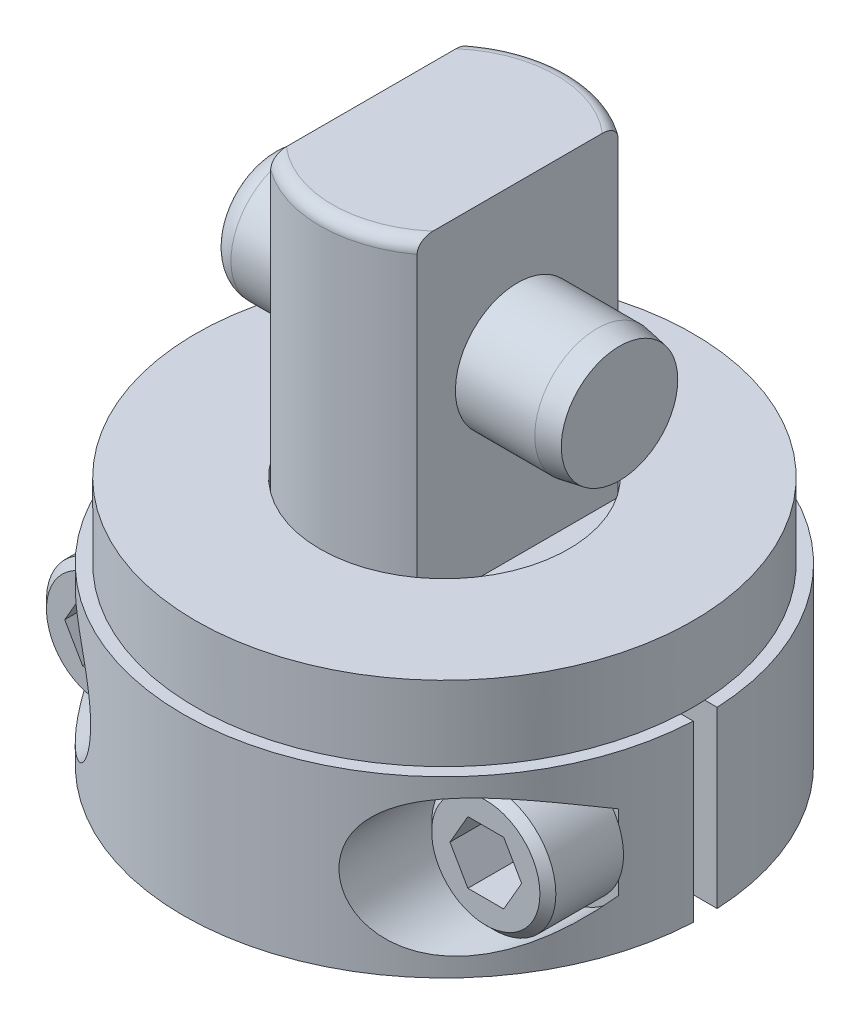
ISO-10303-21;
HEADER;
FILE_DESCRIPTION(('STEP AP214'),'2;1');
FILE_NAME('part.step','',(''),(''),'','','');
FILE_SCHEMA(('AUTOMOTIVE_DESIGN { 1 0 10303 214 1 1 1 1 }'));
ENDSEC;
DATA;
#1=APPLICATION_CONTEXT('core data for automotive mechanical design processes');
#2=APPLICATION_PROTOCOL_DEFINITION('international standard','automotive_design',2000,#1);
#3=PRODUCT_CONTEXT('',#1,'mechanical');
#4=PRODUCT('Part','Part','',(#3));
#5=PRODUCT_RELATED_PRODUCT_CATEGORY('part','',(#4));
#6=PRODUCT_DEFINITION_FORMATION('','',#4);
#7=PRODUCT_DEFINITION_CONTEXT('part definition',#1,'design');
#8=PRODUCT_DEFINITION('design','',#6,#7);
#9=PRODUCT_DEFINITION_SHAPE('','',#8);
#10=(LENGTH_UNIT() NAMED_UNIT(*) SI_UNIT(.MILLI.,.METRE.));
#11=(NAMED_UNIT(*) PLANE_ANGLE_UNIT() SI_UNIT($,.RADIAN.));
#12=(NAMED_UNIT(*) SI_UNIT($,.STERADIAN.) SOLID_ANGLE_UNIT());
#13=UNCERTAINTY_MEASURE_WITH_UNIT(LENGTH_MEASURE(1.E-05),#10,'distance_accuracy_value','');
#14=(GEOMETRIC_REPRESENTATION_CONTEXT(3) GLOBAL_UNCERTAINTY_ASSIGNED_CONTEXT((#13)) GLOBAL_UNIT_ASSIGNED_CONTEXT((#10,
#11,#12)) REPRESENTATION_CONTEXT('',''));
#15=CARTESIAN_POINT('',(0.,0.,0.));
#16=DIRECTION('',(0.,0.,1.));
#17=DIRECTION('',(1.,0.,0.));
#18=AXIS2_PLACEMENT_3D('',#15,#16,#17);
#19=CARTESIAN_POINT('',(0.,-15.35938,0.));
#20=DIRECTION('',(0.,-1.,0.));
#21=DIRECTION('',(0.,0.,-1.));
#22=AXIS2_PLACEMENT_3D('',#19,#20,#21);
#23=CYLINDRICAL_SURFACE('',#22,7.9375);
#24=DIRECTION('',(0.,1.,0.));
#25=VECTOR('',#24,1.);
#26=CARTESIAN_POINT('',(-7.9008393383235,-5.5626,0.762));
#27=LINE('',#26,#25);
#28=CARTESIAN_POINT('',(-7.9008393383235,0.,0.762));
#29=VERTEX_POINT('',#28);
#30=CARTESIAN_POINT('',(-7.90083933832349,5.5626,0.761999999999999));
#31=VERTEX_POINT('',#30);
#32=EDGE_CURVE('E471',#29,#31,#27,.T.);
#33=ORIENTED_EDGE('',*,*,#32,.T.);
#34=CARTESIAN_POINT('',(0.,5.5626,0.));
#35=DIRECTION('',(0.,1.,0.));
#36=DIRECTION('',(0.,0.,1.));
#37=AXIS2_PLACEMENT_3D('',#34,#35,#36);
#38=CIRCLE('',#37,7.9375);
#39=CARTESIAN_POINT('',(-7.90083933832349,5.5626,-0.761999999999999));
#40=VERTEX_POINT('',#39);
#41=EDGE_CURVE('E618',#40,#31,#38,.T.);
#42=ORIENTED_EDGE('',*,*,#41,.F.);
#43=DIRECTION('',(0.,1.,0.));
#44=VECTOR('',#43,1.);
#45=CARTESIAN_POINT('',(-7.9008393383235,-5.5626,-0.762));
#46=LINE('',#45,#44);
#47=CARTESIAN_POINT('',(-7.9008393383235,0.,-0.762));
#48=VERTEX_POINT('',#47);
#49=EDGE_CURVE('E444',#48,#40,#46,.T.);
#50=ORIENTED_EDGE('',*,*,#49,.F.);
#51=CARTESIAN_POINT('',(0.,0.,0.));
#52=DIRECTION('',(0.,-1.,0.));
#53=DIRECTION('',(0.,0.,-1.));
#54=AXIS2_PLACEMENT_3D('',#51,#52,#53);
#55=CIRCLE('',#54,7.93750000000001);
#56=EDGE_CURVE('E323',#29,#48,#55,.T.);
#57=ORIENTED_EDGE('',*,*,#56,.F.);
#58=EDGE_LOOP('',(#33,#42,#50,#57));
#59=FACE_BOUND('',#58,.T.);
#60=ADVANCED_FACE('F35',(#59),#23,.T.);
#61=DIRECTION('',(0.,1.,0.));
#62=VECTOR('',#61,1.);
#63=CARTESIAN_POINT('',(7.9008393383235,-5.5626,-0.762));
#64=LINE('',#63,#62);
#65=CARTESIAN_POINT('',(7.9008393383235,0.,-0.761999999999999));
#66=VERTEX_POINT('',#65);
#67=CARTESIAN_POINT('',(7.90083933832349,5.5626,-0.761999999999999));
#68=VERTEX_POINT('',#67);
#69=EDGE_CURVE('E439',#66,#68,#64,.T.);
#70=ORIENTED_EDGE('',*,*,#69,.T.);
#71=CARTESIAN_POINT('',(7.90083933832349,5.5626,0.761999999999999));
#72=VERTEX_POINT('',#71);
#73=EDGE_CURVE('E301',#72,#68,#38,.T.);
#74=ORIENTED_EDGE('',*,*,#73,.F.);
#75=DIRECTION('',(0.,1.,0.));
#76=VECTOR('',#75,1.);
#77=CARTESIAN_POINT('',(7.9008393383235,-5.5626,0.762));
#78=LINE('',#77,#76);
#79=CARTESIAN_POINT('',(7.9008393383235,0.,0.762));
#80=VERTEX_POINT('',#79);
#81=EDGE_CURVE('E476',#80,#72,#78,.T.);
#82=ORIENTED_EDGE('',*,*,#81,.F.);
#83=EDGE_CURVE('E318',#66,#80,#55,.T.);
#84=ORIENTED_EDGE('',*,*,#83,.F.);
#85=EDGE_LOOP('',(#70,#74,#82,#84));
#86=FACE_BOUND('',#85,.T.);
#87=ADVANCED_FACE('F370',(#86),#23,.T.);
#88=CARTESIAN_POINT('',(0.,5.5626,0.));
#89=DIRECTION('',(0.,1.,0.));
#90=DIRECTION('',(0.,0.,1.));
#91=AXIS2_PLACEMENT_3D('',#88,#89,#90);
#92=PLANE('',#91);
#93=DIRECTION('',(1.,0.,0.));
#94=VECTOR('',#93,1.);
#95=CARTESIAN_POINT('',(-7.9008393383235,5.5626,-0.762));
#96=LINE('',#95,#94);
#97=CARTESIAN_POINT('',(-16.6449670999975,5.5626,-0.76200000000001));
#98=VERTEX_POINT('',#97);
#99=CARTESIAN_POINT('',(-15.8567014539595,5.5626,-0.762000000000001));
#100=VERTEX_POINT('',#99);
#101=EDGE_CURVE('E459',#98,#100,#96,.T.);
#102=ORIENTED_EDGE('',*,*,#101,.T.);
#103=CARTESIAN_POINT('',(0.,5.5626,0.));
#104=DIRECTION('',(0.,1.,0.));
#105=DIRECTION('',(0.,0.,1.));
#106=AXIS2_PLACEMENT_3D('',#103,#104,#105);
#107=CIRCLE('',#106,15.875);
#108=CARTESIAN_POINT('',(15.8567014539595,5.5626,-0.762000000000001));
#109=VERTEX_POINT('',#108);
#110=EDGE_CURVE('E615',#109,#100,#107,.T.);
#111=ORIENTED_EDGE('',*,*,#110,.F.);
#112=DIRECTION('',(1.,0.,0.));
#113=VECTOR('',#112,1.);
#114=CARTESIAN_POINT('',(7.9008393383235,5.5626,-0.762));
#115=LINE('',#114,#113);
#116=CARTESIAN_POINT('',(16.6449670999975,5.5626,-0.762000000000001));
#117=VERTEX_POINT('',#116);
#118=EDGE_CURVE('E467',#109,#117,#115,.T.);
#119=ORIENTED_EDGE('',*,*,#118,.T.);
#120=CARTESIAN_POINT('',(0.,5.5626,0.));
#121=DIRECTION('',(0.,1.,0.));
#122=DIRECTION('',(0.,0.,1.));
#123=AXIS2_PLACEMENT_3D('',#120,#121,#122);
#124=CIRCLE('',#123,16.6624);
#125=EDGE_CURVE('E462',#117,#98,#124,.T.);
#126=ORIENTED_EDGE('',*,*,#125,.T.);
#127=EDGE_LOOP('',(#102,#111,#119,#126));
#128=FACE_BOUND('',#127,.T.);
#129=ADVANCED_FACE('F390',(#128),#92,.T.);
#130=CARTESIAN_POINT('',(0.,5.5626,0.));
#131=DIRECTION('',(0.,1.,0.));
#132=DIRECTION('',(0.,0.,1.));
#133=AXIS2_PLACEMENT_3D('',#130,#131,#132);
#134=PLANE('',#133);
#135=DIRECTION('',(-1.,0.,0.));
#136=VECTOR('',#135,1.);
#137=CARTESIAN_POINT('',(7.9008393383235,5.5626,0.762));
#138=LINE('',#137,#136);
#139=CARTESIAN_POINT('',(16.6449670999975,5.5626,0.762000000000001));
#140=VERTEX_POINT('',#139);
#141=CARTESIAN_POINT('',(15.8567014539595,5.5626,0.762000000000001));
#142=VERTEX_POINT('',#141);
#143=EDGE_CURVE('E492',#140,#142,#138,.T.);
#144=ORIENTED_EDGE('',*,*,#143,.T.);
#145=CARTESIAN_POINT('',(0.,5.5626,0.));
#146=DIRECTION('',(0.,1.,0.));
#147=DIRECTION('',(0.,0.,1.));
#148=AXIS2_PLACEMENT_3D('',#145,#146,#147);
#149=CIRCLE('',#148,15.875);
#150=CARTESIAN_POINT('',(-15.8567014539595,5.5626,0.762000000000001));
#151=VERTEX_POINT('',#150);
#152=EDGE_CURVE('E11',#142,#151,#149,.F.);
#153=ORIENTED_EDGE('',*,*,#152,.T.);
#154=DIRECTION('',(-1.,0.,0.));
#155=VECTOR('',#154,1.);
#156=CARTESIAN_POINT('',(-7.9008393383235,5.5626,0.762));
#157=LINE('',#156,#155);
#158=CARTESIAN_POINT('',(-16.6449670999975,5.5626,0.762000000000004));
#159=VERTEX_POINT('',#158);
#160=EDGE_CURVE('E501',#151,#159,#157,.T.);
#161=ORIENTED_EDGE('',*,*,#160,.T.);
#162=CARTESIAN_POINT('',(0.,5.5626,0.));
#163=DIRECTION('',(0.,1.,0.));
#164=DIRECTION('',(0.,0.,1.));
#165=AXIS2_PLACEMENT_3D('',#162,#163,#164);
#166=CIRCLE('',#165,16.6624);
#167=EDGE_CURVE('E496',#159,#140,#166,.T.);
#168=ORIENTED_EDGE('',*,*,#167,.T.);
#169=EDGE_LOOP('',(#144,#153,#161,#168));
#170=FACE_BOUND('',#169,.T.);
#171=ADVANCED_FACE('F659',(#170),#134,.T.);
#172=CARTESIAN_POINT('',(-12.2936,0.,4.826));
#173=DIRECTION('',(0.,0.,1.));
#174=DIRECTION('',(1.,0.,0.));
#175=AXIS2_PLACEMENT_3D('',#172,#173,#174);
#176=PLANE('',#175);
#177=DIRECTION('',(0.,1.,0.));
#178=VECTOR('',#177,1.);
#179=CARTESIAN_POINT('',(-15.9482067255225,-5.5626,4.826));
#180=LINE('',#179,#178);
#181=CARTESIAN_POINT('',(-15.9482067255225,1.53116408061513,4.826));
#182=VERTEX_POINT('',#181);
#183=CARTESIAN_POINT('',(-15.9482067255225,2.39379680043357,4.826));
#184=VERTEX_POINT('',#183);
#185=EDGE_CURVE('E757',#182,#184,#180,.T.);
#186=ORIENTED_EDGE('',*,*,#185,.F.);
#187=CARTESIAN_POINT('',(-12.2936,0.,4.826));
#188=DIRECTION('',(0.,0.,1.));
#189=DIRECTION('',(1.,0.,0.));
#190=AXIS2_PLACEMENT_3D('',#187,#188,#189);
#191=CIRCLE('',#190,3.9624);
#192=CARTESIAN_POINT('',(-15.9482067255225,-1.53116408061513,4.826));
#193=VERTEX_POINT('',#192);
#194=EDGE_CURVE('E909',#182,#193,#191,.F.);
#195=ORIENTED_EDGE('',*,*,#194,.T.);
#196=CARTESIAN_POINT('',(-15.9482067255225,-2.39379680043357,4.826));
#197=VERTEX_POINT('',#196);
#198=EDGE_CURVE('E758',#197,#193,#180,.T.);
#199=ORIENTED_EDGE('',*,*,#198,.F.);
#200=CARTESIAN_POINT('',(-12.2936,0.,4.826));
#201=DIRECTION('',(0.,0.,1.));
#202=DIRECTION('',(1.,0.,0.));
#203=AXIS2_PLACEMENT_3D('',#200,#201,#202);
#204=CIRCLE('',#203,4.3688);
#205=EDGE_CURVE('E505',#197,#184,#204,.T.);
#206=ORIENTED_EDGE('',*,*,#205,.T.);
#207=EDGE_LOOP('',(#186,#195,#199,#206));
#208=FACE_BOUND('',#207,.T.);
#209=ADVANCED_FACE('F774',(#208),#176,.T.);
#210=CARTESIAN_POINT('',(12.2936,0.,4.826));
#211=DIRECTION('',(0.,0.,1.));
#212=DIRECTION('',(1.,0.,0.));
#213=AXIS2_PLACEMENT_3D('',#210,#211,#212);
#214=PLANE('',#213);
#215=DIRECTION('',(0.,1.,0.));
#216=VECTOR('',#215,1.);
#217=CARTESIAN_POINT('',(15.9482067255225,-5.5626,4.826));
#218=LINE('',#217,#216);
#219=CARTESIAN_POINT('',(15.9482067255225,-1.53116408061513,4.826));
#220=VERTEX_POINT('',#219);
#221=CARTESIAN_POINT('',(15.9482067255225,-2.39379680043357,4.826));
#222=VERTEX_POINT('',#221);
#223=EDGE_CURVE('E744',#220,#222,#218,.F.);
#224=ORIENTED_EDGE('',*,*,#223,.F.);
#225=CARTESIAN_POINT('',(12.2936,0.,4.826));
#226=DIRECTION('',(0.,0.,1.));
#227=DIRECTION('',(1.,0.,0.));
#228=AXIS2_PLACEMENT_3D('',#225,#226,#227);
#229=CIRCLE('',#228,3.9624);
#230=CARTESIAN_POINT('',(15.9482067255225,1.53116408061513,4.826));
#231=VERTEX_POINT('',#230);
#232=EDGE_CURVE('E508',#231,#220,#229,.T.);
#233=ORIENTED_EDGE('',*,*,#232,.F.);
#234=CARTESIAN_POINT('',(15.9482067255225,2.39379680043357,4.826));
#235=VERTEX_POINT('',#234);
#236=EDGE_CURVE('E745',#235,#231,#218,.F.);
#237=ORIENTED_EDGE('',*,*,#236,.F.);
#238=CARTESIAN_POINT('',(12.2936,0.,4.826));
#239=DIRECTION('',(0.,0.,1.));
#240=DIRECTION('',(1.,0.,0.));
#241=AXIS2_PLACEMENT_3D('',#238,#239,#240);
#242=CIRCLE('',#241,4.3688);
#243=EDGE_CURVE('E502',#235,#222,#242,.T.);
#244=ORIENTED_EDGE('',*,*,#243,.T.);
#245=EDGE_LOOP('',(#224,#233,#237,#244));
#246=FACE_BOUND('',#245,.T.);
#247=ADVANCED_FACE('F770',(#246),#214,.T.);
#248=CARTESIAN_POINT('',(0.,-5.5626,0.));
#249=DIRECTION('',(0.,1.,0.));
#250=DIRECTION('',(0.,0.,1.));
#251=AXIS2_PLACEMENT_3D('',#248,#249,#250);
#252=CYLINDRICAL_SURFACE('',#251,16.6624);
#253=ORIENTED_EDGE('',*,*,#236,.T.);
#254=EDGE_CURVE('E749',#231,#220,#218,.F.);
#255=ORIENTED_EDGE('',*,*,#254,.T.);
#256=ORIENTED_EDGE('',*,*,#223,.T.);
#257=CARTESIAN_POINT('',(15.9482067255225,-2.39379680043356,4.826));
#258=CARTESIAN_POINT('',(15.8997045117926,-2.46783957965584,4.98627649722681));
#259=CARTESIAN_POINT('',(15.848661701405,-2.54086260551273,5.14624476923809));
#260=CARTESIAN_POINT('',(15.7414155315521,-2.68459088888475,5.46550887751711));
#261=CARTESIAN_POINT('',(15.6852117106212,-2.75529593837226,5.62480465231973));
#262=CARTESIAN_POINT('',(15.5085713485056,-2.96371177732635,6.1020480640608));
#263=CARTESIAN_POINT('',(15.3802555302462,-3.09749232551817,6.418855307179));
#264=CARTESIAN_POINT('',(15.100625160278,-3.35310346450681,7.05178765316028));
#265=CARTESIAN_POINT('',(14.9490764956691,-3.47478888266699,7.36786817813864));
#266=CARTESIAN_POINT('',(14.6235790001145,-3.70092622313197,7.99443445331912));
#267=CARTESIAN_POINT('',(14.4496469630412,-3.8053909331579,8.30492420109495));
#268=CARTESIAN_POINT('',(14.1393727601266,-3.96221313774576,8.81885566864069));
#269=CARTESIAN_POINT('',(14.0092182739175,-4.02046451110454,9.02425128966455));
#270=CARTESIAN_POINT('',(13.7385927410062,-4.12546648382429,9.43113488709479));
#271=CARTESIAN_POINT('',(13.5981239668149,-4.17221960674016,9.63262371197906));
#272=CARTESIAN_POINT('',(13.3074335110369,-4.25220159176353,10.0303687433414));
#273=CARTESIAN_POINT('',(13.1572396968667,-4.28546727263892,10.226637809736));
#274=CARTESIAN_POINT('',(12.8471999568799,-4.33642843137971,10.6135016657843));
#275=CARTESIAN_POINT('',(12.6873564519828,-4.35412779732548,10.8040978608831));
#276=CARTESIAN_POINT('',(12.3950059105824,-4.36950570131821,11.1371961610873));
#277=CARTESIAN_POINT('',(12.2642251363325,-4.37073326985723,11.281050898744));
#278=CARTESIAN_POINT('',(11.9979350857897,-4.36081887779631,11.5638583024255));
#279=CARTESIAN_POINT('',(11.8624270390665,-4.3496801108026,11.7028122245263));
#280=CARTESIAN_POINT('',(11.5876449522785,-4.31360989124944,11.9749498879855));
#281=CARTESIAN_POINT('',(11.4483734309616,-4.28868745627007,12.1081373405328));
#282=CARTESIAN_POINT('',(11.1672459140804,-4.22356979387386,12.3678929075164));
#283=CARTESIAN_POINT('',(11.0253907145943,-4.18337919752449,12.4944630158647));
#284=CARTESIAN_POINT('',(10.7758195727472,-4.09824404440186,12.7097359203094));
#285=CARTESIAN_POINT('',(10.6682938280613,-4.05690384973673,12.8000918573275));
#286=CARTESIAN_POINT('',(10.4536471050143,-3.96417047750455,12.9759805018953));
#287=CARTESIAN_POINT('',(10.3465260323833,-3.91277980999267,13.0615144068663));
#288=CARTESIAN_POINT('',(10.1338009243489,-3.79949920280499,13.2272379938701));
#289=CARTESIAN_POINT('',(10.0281960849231,-3.73761506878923,13.3074305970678));
#290=CARTESIAN_POINT('',(9.81973456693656,-3.6030238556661,13.4619912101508));
#291=CARTESIAN_POINT('',(9.71687632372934,-3.53032310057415,13.5363625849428));
#292=CARTESIAN_POINT('',(9.53043749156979,-3.38571892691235,13.6681140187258));
#293=CARTESIAN_POINT('',(9.4462862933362,-3.31534384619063,13.7263663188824));
#294=CARTESIAN_POINT('',(9.28188309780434,-3.16674023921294,13.8380666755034));
#295=CARTESIAN_POINT('',(9.20162929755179,-3.0885153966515,13.8915169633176));
#296=CARTESIAN_POINT('',(9.04591519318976,-2.92433931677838,13.9934147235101));
#297=CARTESIAN_POINT('',(8.97045645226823,-2.83838558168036,14.0418605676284));
#298=CARTESIAN_POINT('',(8.82536147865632,-2.65913962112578,14.1335038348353));
#299=CARTESIAN_POINT('',(8.75572283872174,-2.56585046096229,14.1767034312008));
#300=CARTESIAN_POINT('',(8.62282640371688,-2.37186241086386,14.2579289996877));
#301=CARTESIAN_POINT('',(8.55960514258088,-2.27112618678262,14.2959257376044));
#302=CARTESIAN_POINT('',(8.44091772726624,-2.0633846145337,14.3663232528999));
#303=CARTESIAN_POINT('',(8.38544811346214,-1.95638209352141,14.398726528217));
#304=CARTESIAN_POINT('',(8.28305876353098,-1.73684860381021,14.4578701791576));
#305=CARTESIAN_POINT('',(8.23613958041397,-1.62431727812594,14.4846101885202));
#306=CARTESIAN_POINT('',(8.15157957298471,-1.39465069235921,14.5323668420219));
#307=CARTESIAN_POINT('',(8.11393791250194,-1.27751584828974,14.5533840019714));
#308=CARTESIAN_POINT('',(8.05152358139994,-1.05059538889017,14.5879982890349));
#309=CARTESIAN_POINT('',(8.02588624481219,-0.941123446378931,14.6020997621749));
#310=CARTESIAN_POINT('',(7.9830657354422,-0.719995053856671,14.6255541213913));
#311=CARTESIAN_POINT('',(7.96588536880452,-0.608337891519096,14.6349054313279));
#312=CARTESIAN_POINT('',(7.94022609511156,-0.383809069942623,14.64884284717));
#313=CARTESIAN_POINT('',(7.93174144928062,-0.270938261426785,14.6534320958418));
#314=CARTESIAN_POINT('',(7.92356303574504,-0.0447427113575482,14.6578560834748));
#315=CARTESIAN_POINT('',(7.92387245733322,0.0685821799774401,14.6576890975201));
#316=CARTESIAN_POINT('',(7.933088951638,0.290040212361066,14.6527027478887));
#317=CARTESIAN_POINT('',(7.9416371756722,0.398192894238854,14.6480775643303));
#318=CARTESIAN_POINT('',(7.9667107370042,0.613330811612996,14.6344558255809));
#319=CARTESIAN_POINT('',(7.98323889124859,0.720315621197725,14.6254577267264));
#320=CARTESIAN_POINT('',(8.02406587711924,0.932273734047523,14.603098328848));
#321=CARTESIAN_POINT('',(8.04836100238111,1.03724797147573,14.5897391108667));
#322=CARTESIAN_POINT('',(8.10444325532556,1.24455443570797,14.5586606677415));
#323=CARTESIAN_POINT('',(8.13623316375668,1.34688566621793,14.5409398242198));
#324=CARTESIAN_POINT('',(8.20703032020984,1.54848383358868,14.5010992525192));
#325=CARTESIAN_POINT('',(8.246058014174,1.64774113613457,14.4789670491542));
#326=CARTESIAN_POINT('',(8.33080685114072,1.84227101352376,14.4303713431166));
#327=CARTESIAN_POINT('',(8.3765303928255,1.93754214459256,14.4039062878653));
#328=CARTESIAN_POINT('',(8.52295257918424,2.21643838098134,14.3180881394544));
#329=CARTESIAN_POINT('',(8.63296992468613,2.3933345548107,14.252275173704));
#330=CARTESIAN_POINT('',(8.87821265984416,2.73265040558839,14.1008694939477));
#331=CARTESIAN_POINT('',(9.01434556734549,2.89406845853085,14.0145236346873));
#332=CARTESIAN_POINT('',(9.30234016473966,3.19085591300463,13.825040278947));
#333=CARTESIAN_POINT('',(9.4542066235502,3.32621738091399,13.721897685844));
#334=CARTESIAN_POINT('',(9.78402403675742,3.58280596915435,13.4890036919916));
#335=CARTESIAN_POINT('',(9.96305033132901,3.70113949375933,13.3576056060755));
#336=CARTESIAN_POINT('',(10.3264476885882,3.90644958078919,13.0787058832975));
#337=CARTESIAN_POINT('',(10.5108220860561,3.99340610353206,12.9311940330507));
#338=CARTESIAN_POINT('',(10.8343416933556,4.12060530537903,12.6603992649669));
#339=CARTESIAN_POINT('',(10.973532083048,4.16707043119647,12.5400015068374));
#340=CARTESIAN_POINT('',(11.2501837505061,4.24480191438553,12.2924117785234));
#341=CARTESIAN_POINT('',(11.3876443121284,4.27606216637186,12.16521710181));
#342=CARTESIAN_POINT('',(11.659582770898,4.32475972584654,11.9048393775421));
#343=CARTESIAN_POINT('',(11.7940567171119,4.34217967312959,11.7716490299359));
#344=CARTESIAN_POINT('',(12.0588942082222,4.36451499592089,11.5002015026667));
#345=CARTESIAN_POINT('',(12.1892564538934,4.36942645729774,11.3619427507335));
#346=CARTESIAN_POINT('',(12.5021557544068,4.36773849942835,11.0184857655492));
#347=CARTESIAN_POINT('',(12.6820617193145,4.35503572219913,10.8109079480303));
#348=CARTESIAN_POINT('',(13.0304093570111,4.30980234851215,10.3884110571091));
#349=CARTESIAN_POINT('',(13.1988456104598,4.27726245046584,10.1734885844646));
#350=CARTESIAN_POINT('',(13.5241677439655,4.1952788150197,9.73688191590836));
#351=CARTESIAN_POINT('',(13.6810046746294,4.14576791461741,9.5151740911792));
#352=CARTESIAN_POINT('',(13.9821241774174,4.03251524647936,9.06690321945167));
#353=CARTESIAN_POINT('',(14.1264033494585,3.96876964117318,8.84033887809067));
#354=CARTESIAN_POINT('',(14.4500003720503,3.80521047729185,8.30433753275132));
#355=CARTESIAN_POINT('',(14.6242162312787,3.70054294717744,7.99329621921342));
#356=CARTESIAN_POINT('',(14.9501963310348,3.47395108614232,7.36562355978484));
#357=CARTESIAN_POINT('',(15.1019451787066,3.35201503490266,7.04898854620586));
#358=CARTESIAN_POINT('',(15.381410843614,3.09631850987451,6.41605232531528));
#359=CARTESIAN_POINT('',(15.5094381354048,2.96275038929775,6.09981014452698));
#360=CARTESIAN_POINT('',(15.6857073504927,2.75468029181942,5.62341322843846));
#361=CARTESIAN_POINT('',(15.7417991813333,2.68409276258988,5.46439461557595));
#362=CARTESIAN_POINT('',(15.8488399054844,2.54060768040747,5.14568630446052));
#363=CARTESIAN_POINT('',(15.8997892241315,2.46771031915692,4.98599666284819));
#364=CARTESIAN_POINT('',(15.9482067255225,2.39379680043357,4.826));
#365=B_SPLINE_CURVE_WITH_KNOTS('',3,(#257,#258,#259,#260,#261,#262,#263,#264,#265,#266,#267,
#268,#269,#270,#271,#272,#273,#274,#275,#276,#277,#278,#279,#280,#281,#282,#283,#284,#285,#286,
#287,#288,#289,#290,#291,#292,#293,#294,#295,#296,#297,#298,#299,#300,#301,#302,#303,#304,#305,
#306,#307,#308,#309,#310,#311,#312,#313,#314,#315,#316,#317,#318,#319,#320,#321,#322,#323,#324,
#325,#326,#327,#328,#329,#330,#331,#332,#333,#334,#335,#336,#337,#338,#339,#340,#341,#342,#343,
#344,#345,#346,#347,#348,#349,#350,#351,#352,#353,#354,#355,#356,#357,#358,#359,#360,#361,#362,
#363,#364),.UNSPECIFIED.,.F.,.F.,(4,2,2,2,2,2,2,2,2,2,2,2,2,2,2,2,2,2,2,2,2,2,2,2,2,2,2,2,2,2,2,
2,2,2,2,2,2,2,2,2,2,2,2,2,2,2,2,2,2,2,2,2,2,4),(0.,0.549239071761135,1.09852730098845,
2.19880360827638,3.31100062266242,4.42236798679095,5.17205816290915,5.92158365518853,
6.66904904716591,7.41632768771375,7.99913796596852,8.58179776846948,9.16407683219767,
9.74617942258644,10.1850203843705,10.6237518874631,11.062241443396,11.5004756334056,
11.8727213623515,12.2447932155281,12.6169857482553,12.9890235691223,13.3630728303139,
13.7369546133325,14.1108605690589,14.4847328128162,14.824251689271,15.1638831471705,
15.503290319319,15.8428205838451,16.1682007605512,16.4936958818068,16.8190359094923,
17.1444968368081,17.4708915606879,17.7974034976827,18.4498249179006,19.1314326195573,
19.8132475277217,20.5653170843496,21.3178661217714,21.8865609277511,22.4554839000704,
23.0251193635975,23.5949330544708,24.4186160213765,25.2426855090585,26.0700546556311,
26.8976471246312,28.0109834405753,29.1250790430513,30.2233647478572,30.7716906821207,
31.3199712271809),.UNSPECIFIED.);
#366=EDGE_CURVE('E748',#222,#235,#365,.T.);
#367=ORIENTED_EDGE('',*,*,#366,.T.);
#368=EDGE_LOOP('',(#253,#255,#256,#367));
#369=FACE_BOUND('',#368,.T.);
#370=DIRECTION('',(0.,1.,0.));
#371=VECTOR('',#370,1.);
#372=CARTESIAN_POINT('',(16.6449670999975,-5.5626,0.762000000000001));
#373=LINE('',#372,#371);
#374=CARTESIAN_POINT('',(16.6449670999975,-5.5626,0.762000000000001));
#375=VERTEX_POINT('',#374);
#376=EDGE_CURVE('E474',#375,#140,#373,.T.);
#377=ORIENTED_EDGE('',*,*,#376,.T.);
#378=ORIENTED_EDGE('',*,*,#167,.F.);
#379=DIRECTION('',(0.,1.,0.));
#380=VECTOR('',#379,1.);
#381=CARTESIAN_POINT('',(-16.6449670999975,-5.5626,0.762000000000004));
#382=LINE('',#381,#380);
#383=CARTESIAN_POINT('',(-16.6449670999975,-5.5626,0.762000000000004));
#384=VERTEX_POINT('',#383);
#385=EDGE_CURVE('E470',#384,#159,#382,.T.);
#386=ORIENTED_EDGE('',*,*,#385,.F.);
#387=CARTESIAN_POINT('',(0.,-5.5626,0.));
#388=DIRECTION('',(0.,1.,0.));
#389=DIRECTION('',(0.,0.,1.));
#390=AXIS2_PLACEMENT_3D('',#387,#388,#389);
#391=CIRCLE('',#390,16.6624);
#392=EDGE_CURVE('E483',#384,#375,#391,.T.);
#393=ORIENTED_EDGE('',*,*,#392,.T.);
#394=EDGE_LOOP('',(#377,#378,#386,#393));
#395=FACE_BOUND('',#394,.T.);
#396=ORIENTED_EDGE('',*,*,#198,.T.);
#397=EDGE_CURVE('E1471',#193,#182,#180,.T.);
#398=ORIENTED_EDGE('',*,*,#397,.T.);
#399=ORIENTED_EDGE('',*,*,#185,.T.);
#400=CARTESIAN_POINT('',(-15.9482067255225,2.39379680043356,4.826));
#401=CARTESIAN_POINT('',(-15.8997045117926,2.46783957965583,4.98627649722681));
#402=CARTESIAN_POINT('',(-15.848661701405,2.54086260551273,5.1462447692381));
#403=CARTESIAN_POINT('',(-15.7414155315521,2.68459088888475,5.46550887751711));
#404=CARTESIAN_POINT('',(-15.6852117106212,2.75529593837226,5.62480465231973));
#405=CARTESIAN_POINT('',(-15.5085713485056,2.96371177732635,6.10204806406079));
#406=CARTESIAN_POINT('',(-15.3802555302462,3.09749232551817,6.418855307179));
#407=CARTESIAN_POINT('',(-15.100625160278,3.3531034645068,7.05178765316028));
#408=CARTESIAN_POINT('',(-14.9490764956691,3.47478888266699,7.36786817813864));
#409=CARTESIAN_POINT('',(-14.6235790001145,3.70092622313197,7.99443445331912));
#410=CARTESIAN_POINT('',(-14.4496469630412,3.8053909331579,8.30492420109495));
#411=CARTESIAN_POINT('',(-14.1393727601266,3.96221313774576,8.81885566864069));
#412=CARTESIAN_POINT('',(-14.0092182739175,4.02046451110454,9.02425128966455));
#413=CARTESIAN_POINT('',(-13.7385927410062,4.12546648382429,9.43113488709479));
#414=CARTESIAN_POINT('',(-13.5981239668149,4.17221960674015,9.63262371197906));
#415=CARTESIAN_POINT('',(-13.3074335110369,4.25220159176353,10.0303687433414));
#416=CARTESIAN_POINT('',(-13.1572396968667,4.28546727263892,10.226637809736));
#417=CARTESIAN_POINT('',(-12.8471999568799,4.33642843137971,10.6135016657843));
#418=CARTESIAN_POINT('',(-12.6873564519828,4.35412779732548,10.8040978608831));
#419=CARTESIAN_POINT('',(-12.3950059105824,4.36950570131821,11.1371961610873));
#420=CARTESIAN_POINT('',(-12.2642251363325,4.37073326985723,11.281050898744));
#421=CARTESIAN_POINT('',(-11.9979350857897,4.36081887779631,11.5638583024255));
#422=CARTESIAN_POINT('',(-11.8624270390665,4.3496801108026,11.7028122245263));
#423=CARTESIAN_POINT('',(-11.5876449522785,4.31360989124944,11.9749498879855));
#424=CARTESIAN_POINT('',(-11.4483734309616,4.28868745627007,12.1081373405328));
#425=CARTESIAN_POINT('',(-11.1672459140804,4.22356979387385,12.3678929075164));
#426=CARTESIAN_POINT('',(-11.0253907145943,4.18337919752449,12.4944630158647));
#427=CARTESIAN_POINT('',(-10.7758195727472,4.09824404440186,12.7097359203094));
#428=CARTESIAN_POINT('',(-10.6682938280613,4.05690384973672,12.8000918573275));
#429=CARTESIAN_POINT('',(-10.4536471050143,3.96417047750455,12.9759805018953));
#430=CARTESIAN_POINT('',(-10.3465260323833,3.91277980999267,13.0615144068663));
#431=CARTESIAN_POINT('',(-10.1338009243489,3.79949920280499,13.2272379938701));
#432=CARTESIAN_POINT('',(-10.0281960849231,3.73761506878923,13.3074305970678));
#433=CARTESIAN_POINT('',(-9.81973456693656,3.6030238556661,13.4619912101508));
#434=CARTESIAN_POINT('',(-9.71687632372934,3.53032310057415,13.5363625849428));
#435=CARTESIAN_POINT('',(-9.53043749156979,3.38571892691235,13.6681140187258));
#436=CARTESIAN_POINT('',(-9.4462862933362,3.31534384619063,13.7263663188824));
#437=CARTESIAN_POINT('',(-9.28188309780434,3.16674023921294,13.8380666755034));
#438=CARTESIAN_POINT('',(-9.20162929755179,3.0885153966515,13.8915169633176));
#439=CARTESIAN_POINT('',(-9.04591519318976,2.92433931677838,13.9934147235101));
#440=CARTESIAN_POINT('',(-8.97045645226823,2.83838558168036,14.0418605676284));
#441=CARTESIAN_POINT('',(-8.82536147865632,2.65913962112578,14.1335038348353));
#442=CARTESIAN_POINT('',(-8.75572283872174,2.56585046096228,14.1767034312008));
#443=CARTESIAN_POINT('',(-8.62282640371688,2.37186241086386,14.2579289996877));
#444=CARTESIAN_POINT('',(-8.55960514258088,2.27112618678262,14.2959257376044));
#445=CARTESIAN_POINT('',(-8.44091772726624,2.0633846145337,14.3663232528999));
#446=CARTESIAN_POINT('',(-8.38544811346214,1.95638209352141,14.398726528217));
#447=CARTESIAN_POINT('',(-8.28305876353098,1.73684860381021,14.4578701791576));
#448=CARTESIAN_POINT('',(-8.23613958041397,1.62431727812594,14.4846101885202));
#449=CARTESIAN_POINT('',(-8.15157957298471,1.3946506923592,14.5323668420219));
#450=CARTESIAN_POINT('',(-8.11393791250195,1.27751584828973,14.5533840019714));
#451=CARTESIAN_POINT('',(-8.05152358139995,1.05059538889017,14.5879982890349));
#452=CARTESIAN_POINT('',(-8.02588624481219,0.941123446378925,14.6020997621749));
#453=CARTESIAN_POINT('',(-7.9830657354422,0.719995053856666,14.6255541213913));
#454=CARTESIAN_POINT('',(-7.96588536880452,0.608337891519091,14.6349054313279));
#455=CARTESIAN_POINT('',(-7.94022609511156,0.383809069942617,14.64884284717));
#456=CARTESIAN_POINT('',(-7.93174144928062,0.27093826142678,14.6534320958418));
#457=CARTESIAN_POINT('',(-7.92356303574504,0.0447427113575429,14.6578560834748));
#458=CARTESIAN_POINT('',(-7.92387245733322,-0.0685821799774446,14.6576890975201));
#459=CARTESIAN_POINT('',(-7.933088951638,-0.29004021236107,14.6527027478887));
#460=CARTESIAN_POINT('',(-7.94163717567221,-0.398192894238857,14.6480775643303));
#461=CARTESIAN_POINT('',(-7.9667107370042,-0.613330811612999,14.6344558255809));
#462=CARTESIAN_POINT('',(-7.98323889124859,-0.720315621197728,14.6254577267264));
#463=CARTESIAN_POINT('',(-8.02406587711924,-0.932273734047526,14.603098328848));
#464=CARTESIAN_POINT('',(-8.04836100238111,-1.03724797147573,14.5897391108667));
#465=CARTESIAN_POINT('',(-8.10444325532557,-1.24455443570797,14.5586606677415));
#466=CARTESIAN_POINT('',(-8.13623316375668,-1.34688566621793,14.5409398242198));
#467=CARTESIAN_POINT('',(-8.20703032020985,-1.54848383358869,14.5010992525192));
#468=CARTESIAN_POINT('',(-8.24605801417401,-1.64774113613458,14.4789670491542));
#469=CARTESIAN_POINT('',(-8.33080685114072,-1.84227101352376,14.4303713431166));
#470=CARTESIAN_POINT('',(-8.3765303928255,-1.93754214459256,14.4039062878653));
#471=CARTESIAN_POINT('',(-8.52295257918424,-2.21643838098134,14.3180881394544));
#472=CARTESIAN_POINT('',(-8.63296992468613,-2.3933345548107,14.252275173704));
#473=CARTESIAN_POINT('',(-8.87821265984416,-2.73265040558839,14.1008694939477));
#474=CARTESIAN_POINT('',(-9.0143455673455,-2.89406845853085,14.0145236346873));
#475=CARTESIAN_POINT('',(-9.30234016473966,-3.19085591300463,13.825040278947));
#476=CARTESIAN_POINT('',(-9.45420662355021,-3.32621738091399,13.721897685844));
#477=CARTESIAN_POINT('',(-9.78402403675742,-3.58280596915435,13.4890036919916));
#478=CARTESIAN_POINT('',(-9.96305033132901,-3.70113949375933,13.3576056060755));
#479=CARTESIAN_POINT('',(-10.3264476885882,-3.90644958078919,13.0787058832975));
#480=CARTESIAN_POINT('',(-10.5108220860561,-3.99340610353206,12.9311940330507));
#481=CARTESIAN_POINT('',(-10.8343416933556,-4.12060530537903,12.6603992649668));
#482=CARTESIAN_POINT('',(-10.973532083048,-4.16707043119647,12.5400015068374));
#483=CARTESIAN_POINT('',(-11.2501837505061,-4.24480191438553,12.2924117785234));
#484=CARTESIAN_POINT('',(-11.3876443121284,-4.27606216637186,12.16521710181));
#485=CARTESIAN_POINT('',(-11.659582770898,-4.32475972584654,11.9048393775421));
#486=CARTESIAN_POINT('',(-11.7940567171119,-4.34217967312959,11.7716490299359));
#487=CARTESIAN_POINT('',(-12.0588942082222,-4.36451499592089,11.5002015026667));
#488=CARTESIAN_POINT('',(-12.1892564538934,-4.36942645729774,11.3619427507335));
#489=CARTESIAN_POINT('',(-12.5021557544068,-4.36773849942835,11.0184857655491));
#490=CARTESIAN_POINT('',(-12.6820617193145,-4.35503572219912,10.8109079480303));
#491=CARTESIAN_POINT('',(-13.0304093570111,-4.30980234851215,10.3884110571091));
#492=CARTESIAN_POINT('',(-13.1988456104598,-4.27726245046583,10.1734885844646));
#493=CARTESIAN_POINT('',(-13.5241677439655,-4.1952788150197,9.73688191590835));
#494=CARTESIAN_POINT('',(-13.6810046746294,-4.1457679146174,9.51517409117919));
#495=CARTESIAN_POINT('',(-13.9821241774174,-4.03251524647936,9.06690321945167));
#496=CARTESIAN_POINT('',(-14.1264033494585,-3.96876964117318,8.84033887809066));
#497=CARTESIAN_POINT('',(-14.4500003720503,-3.80521047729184,8.30433753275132));
#498=CARTESIAN_POINT('',(-14.6242162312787,-3.70054294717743,7.99329621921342));
#499=CARTESIAN_POINT('',(-14.9501963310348,-3.47395108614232,7.36562355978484));
#500=CARTESIAN_POINT('',(-15.1019451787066,-3.35201503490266,7.04898854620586));
#501=CARTESIAN_POINT('',(-15.381410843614,-3.09631850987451,6.41605232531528));
#502=CARTESIAN_POINT('',(-15.5094381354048,-2.96275038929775,6.09981014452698));
#503=CARTESIAN_POINT('',(-15.6857073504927,-2.75468029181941,5.62341322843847));
#504=CARTESIAN_POINT('',(-15.7417991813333,-2.68409276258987,5.46439461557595));
#505=CARTESIAN_POINT('',(-15.8488399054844,-2.54060768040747,5.14568630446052));
#506=CARTESIAN_POINT('',(-15.8997892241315,-2.46771031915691,4.98599666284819));
#507=CARTESIAN_POINT('',(-15.9482067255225,-2.39379680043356,4.82599999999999));
#508=B_SPLINE_CURVE_WITH_KNOTS('',3,(#400,#401,#402,#403,#404,#405,#406,#407,#408,#409,#410,
#411,#412,#413,#414,#415,#416,#417,#418,#419,#420,#421,#422,#423,#424,#425,#426,#427,#428,#429,
#430,#431,#432,#433,#434,#435,#436,#437,#438,#439,#440,#441,#442,#443,#444,#445,#446,#447,#448,
#449,#450,#451,#452,#453,#454,#455,#456,#457,#458,#459,#460,#461,#462,#463,#464,#465,#466,#467,
#468,#469,#470,#471,#472,#473,#474,#475,#476,#477,#478,#479,#480,#481,#482,#483,#484,#485,#486,
#487,#488,#489,#490,#491,#492,#493,#494,#495,#496,#497,#498,#499,#500,#501,#502,#503,#504,#505,
#506,#507),.UNSPECIFIED.,.F.,.F.,(4,2,2,2,2,2,2,2,2,2,2,2,2,2,2,2,2,2,2,2,2,2,2,2,2,2,2,2,2,2,2,
2,2,2,2,2,2,2,2,2,2,2,2,2,2,2,2,2,2,2,2,2,2,4),(0.,0.549239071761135,1.09852730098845,
2.19880360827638,3.31100062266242,4.42236798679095,5.17205816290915,5.92158365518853,
6.66904904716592,7.41632768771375,7.99913796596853,8.58179776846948,9.16407683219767,
9.74617942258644,10.1850203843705,10.6237518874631,11.062241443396,11.5004756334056,
11.8727213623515,12.2447932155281,12.6169857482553,12.9890235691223,13.3630728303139,
13.7369546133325,14.1108605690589,14.4847328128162,14.824251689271,15.1638831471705,
15.503290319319,15.8428205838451,16.1682007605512,16.4936958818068,16.8190359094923,
17.1444968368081,17.4708915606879,17.7974034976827,18.4498249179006,19.1314326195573,
19.8132475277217,20.5653170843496,21.3178661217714,21.8865609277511,22.4554839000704,
23.0251193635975,23.5949330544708,24.4186160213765,25.2426855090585,26.0700546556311,
26.8976471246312,28.0109834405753,29.1250790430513,30.2233647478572,30.7716906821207,
31.3199712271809),.UNSPECIFIED.);
#509=EDGE_CURVE('E903',#184,#197,#508,.T.);
#510=ORIENTED_EDGE('',*,*,#509,.T.);
#511=EDGE_LOOP('',(#396,#398,#399,#510));
#512=FACE_BOUND('',#511,.T.);
#513=ADVANCED_FACE('F365',(#369,#395,#512),#252,.T.);
#514=CARTESIAN_POINT('',(0.,0.,-7.93750000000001));
#515=DIRECTION('',(0.,-1.,0.));
#516=DIRECTION('',(0.,0.,-1.));
#517=AXIS2_PLACEMENT_3D('',#514,#515,#516);
#518=PLANE('',#517);
#519=ORIENTED_EDGE('',*,*,#83,.T.);
#520=EDGE_CURVE('E322',#80,#29,#55,.T.);
#521=ORIENTED_EDGE('',*,*,#520,.T.);
#522=ORIENTED_EDGE('',*,*,#56,.T.);
#523=EDGE_CURVE('E317',#48,#66,#55,.T.);
#524=ORIENTED_EDGE('',*,*,#523,.T.);
#525=EDGE_LOOP('',(#519,#521,#522,#524));
#526=FACE_BOUND('',#525,.T.);
#527=CARTESIAN_POINT('',(0.,0.,0.));
#528=DIRECTION('',(0.,-1.,0.));
#529=DIRECTION('',(0.,0.,-1.));
#530=AXIS2_PLACEMENT_3D('',#527,#528,#529);
#531=CIRCLE('',#530,4.064);
#532=CARTESIAN_POINT('',(0.,0.,-4.064));
#533=VERTEX_POINT('',#532);
#534=EDGE_CURVE('E425',#533,#533,#531,.T.);
#535=ORIENTED_EDGE('',*,*,#534,.F.);
#536=EDGE_LOOP('',(#535));
#537=FACE_BOUND('',#536,.T.);
#538=ADVANCED_FACE('F361',(#526,#537),#518,.T.);
#539=CARTESIAN_POINT('',(0.,-2.54,0.));
#540=DIRECTION('',(0.,-1.,0.));
#541=DIRECTION('',(0.,0.,-1.));
#542=AXIS2_PLACEMENT_3D('',#539,#540,#541);
#543=PLANE('',#542);
#544=CARTESIAN_POINT('',(0.,-2.54,0.));
#545=DIRECTION('',(0.,-1.,0.));
#546=DIRECTION('',(0.,0.,-1.));
#547=AXIS2_PLACEMENT_3D('',#544,#545,#546);
#548=CIRCLE('',#547,4.7625);
#549=CARTESIAN_POINT('',(0.,-2.54,-4.7625));
#550=VERTEX_POINT('',#549);
#551=EDGE_CURVE('E420',#550,#550,#548,.T.);
#552=ORIENTED_EDGE('',*,*,#551,.F.);
#553=EDGE_LOOP('',(#552));
#554=FACE_BOUND('',#553,.T.);
#555=CARTESIAN_POINT('',(0.,-2.54,0.));
#556=DIRECTION('',(0.,-1.,0.));
#557=DIRECTION('',(0.,0.,-1.));
#558=AXIS2_PLACEMENT_3D('',#555,#556,#557);
#559=CIRCLE('',#558,4.064);
#560=CARTESIAN_POINT('',(0.,-2.54,-4.064));
#561=VERTEX_POINT('',#560);
#562=EDGE_CURVE('E424',#561,#561,#559,.T.);
#563=ORIENTED_EDGE('',*,*,#562,.T.);
#564=EDGE_LOOP('',(#563));
#565=FACE_BOUND('',#564,.T.);
#566=ADVANCED_FACE('F364',(#554,#565),#543,.F.);
#567=CARTESIAN_POINT('',(0.,-2.54,0.));
#568=DIRECTION('',(0.,1.,0.));
#569=DIRECTION('',(0.,0.,1.));
#570=AXIS2_PLACEMENT_3D('',#567,#568,#569);
#571=CYLINDRICAL_SURFACE('',#570,4.064);
#572=ORIENTED_EDGE('',*,*,#562,.F.);
#573=EDGE_LOOP('',(#572));
#574=FACE_BOUND('',#573,.T.);
#575=ORIENTED_EDGE('',*,*,#534,.T.);
#576=EDGE_LOOP('',(#575));
#577=FACE_BOUND('',#576,.T.);
#578=ADVANCED_FACE('F355',(#574,#577),#571,.T.);
#579=CARTESIAN_POINT('',(0.,-11.176,-4.7625));
#580=DIRECTION('',(0.,-1.,0.));
#581=DIRECTION('',(0.,0.,-1.));
#582=AXIS2_PLACEMENT_3D('',#579,#580,#581);
#583=PLANE('',#582);
#584=CARTESIAN_POINT('',(0.,-11.176,0.));
#585=DIRECTION('',(0.,-1.,0.));
#586=DIRECTION('',(0.,0.,-1.));
#587=AXIS2_PLACEMENT_3D('',#584,#585,#586);
#588=CIRCLE('',#587,4.0005);
#589=CARTESIAN_POINT('',(0.,-11.176,-4.0005));
#590=VERTEX_POINT('',#589);
#591=EDGE_CURVE('E725',#590,#590,#588,.T.);
#592=ORIENTED_EDGE('',*,*,#591,.T.);
#593=EDGE_LOOP('',(#592));
#594=FACE_BOUND('',#593,.T.);
#595=ADVANCED_FACE('F350',(#594),#583,.T.);
#596=CARTESIAN_POINT('',(0.,-15.35938,0.));
#597=DIRECTION('',(0.,-1.,0.));
#598=DIRECTION('',(0.,0.,-1.));
#599=AXIS2_PLACEMENT_3D('',#596,#597,#598);
#600=CYLINDRICAL_SURFACE('',#599,4.7625);
#601=CARTESIAN_POINT('',(0.,-10.414,0.));
#602=DIRECTION('',(0.,-1.,0.));
#603=DIRECTION('',(0.,0.,-1.));
#604=AXIS2_PLACEMENT_3D('',#601,#602,#603);
#605=CIRCLE('',#604,4.7625);
#606=CARTESIAN_POINT('',(0.,-10.414,-4.7625));
#607=VERTEX_POINT('',#606);
#608=EDGE_CURVE('E728',#607,#607,#605,.F.);
#609=ORIENTED_EDGE('',*,*,#608,.T.);
#610=EDGE_LOOP('',(#609));
#611=FACE_BOUND('',#610,.T.);
#612=ORIENTED_EDGE('',*,*,#551,.T.);
#613=EDGE_LOOP('',(#612));
#614=FACE_BOUND('',#613,.T.);
#615=ADVANCED_FACE('F354',(#611,#614),#600,.T.);
#616=CARTESIAN_POINT('',(0.,-11.176,0.));
#617=DIRECTION('',(0.,1.,0.));
#618=DIRECTION('',(0.,0.,1.));
#619=AXIS2_PLACEMENT_3D('',#616,#617,#618);
#620=CONICAL_SURFACE('',#619,4.0005,0.785398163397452);
#621=ORIENTED_EDGE('',*,*,#608,.F.);
#622=EDGE_LOOP('',(#621));
#623=FACE_BOUND('',#622,.T.);
#624=ORIENTED_EDGE('',*,*,#591,.F.);
#625=EDGE_LOOP('',(#624));
#626=FACE_BOUND('',#625,.T.);
#627=ADVANCED_FACE('F359',(#623,#626),#620,.T.);
#628=CARTESIAN_POINT('',(0.,-5.5626,0.));
#629=DIRECTION('',(0.,1.,0.));
#630=DIRECTION('',(0.,0.,1.));
#631=AXIS2_PLACEMENT_3D('',#628,#629,#630);
#632=CYLINDRICAL_SURFACE('',#631,7.93750000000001);
#633=CARTESIAN_POINT('',(7.9008393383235,-5.5626,-0.762));
#634=VERTEX_POINT('',#633);
#635=EDGE_CURVE('E436',#634,#66,#64,.T.);
#636=ORIENTED_EDGE('',*,*,#635,.T.);
#637=ORIENTED_EDGE('',*,*,#523,.F.);
#638=CARTESIAN_POINT('',(-7.9008393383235,-5.5626,-0.762));
#639=VERTEX_POINT('',#638);
#640=EDGE_CURVE('E428',#639,#48,#46,.T.);
#641=ORIENTED_EDGE('',*,*,#640,.F.);
#642=CARTESIAN_POINT('',(0.,-5.5626,0.));
#643=DIRECTION('',(0.,-1.,0.));
#644=DIRECTION('',(0.,0.,1.));
#645=AXIS2_PLACEMENT_3D('',#642,#643,#644);
#646=CIRCLE('',#645,7.93750000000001);
#647=EDGE_CURVE('E456',#639,#634,#646,.T.);
#648=ORIENTED_EDGE('',*,*,#647,.T.);
#649=EDGE_LOOP('',(#636,#637,#641,#648));
#650=FACE_BOUND('',#649,.T.);
#651=ADVANCED_FACE('F674',(#650),#632,.F.);
#652=CARTESIAN_POINT('',(-7.9008393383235,-5.5626,-0.762));
#653=DIRECTION('',(0.,0.,1.));
#654=DIRECTION('',(1.,0.,0.));
#655=AXIS2_PLACEMENT_3D('',#652,#653,#654);
#656=PLANE('',#655);
#657=CARTESIAN_POINT('',(-12.2936,0.,-0.762000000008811));
#658=DIRECTION('',(0.,0.,1.));
#659=DIRECTION('',(1.,0.,0.));
#660=AXIS2_PLACEMENT_3D('',#657,#658,#659);
#661=CIRCLE('',#660,2.413);
#662=CARTESIAN_POINT('',(-9.8806,0.,-0.762000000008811));
#663=VERTEX_POINT('',#662);
#664=EDGE_CURVE('E43',#663,#663,#661,.T.);
#665=ORIENTED_EDGE('',*,*,#664,.F.);
#666=EDGE_LOOP('',(#665));
#667=FACE_BOUND('',#666,.T.);
#668=ORIENTED_EDGE('',*,*,#640,.T.);
#669=ORIENTED_EDGE('',*,*,#49,.T.);
#670=DIRECTION('',(-1.,0.,0.));
#671=VECTOR('',#670,1.);
#672=CARTESIAN_POINT('',(-7.9008393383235,5.5626,-0.762));
#673=LINE('',#672,#671);
#674=EDGE_CURVE('E279',#40,#100,#673,.T.);
#675=ORIENTED_EDGE('',*,*,#674,.T.);
#676=ORIENTED_EDGE('',*,*,#101,.F.);
#677=DIRECTION('',(0.,1.,0.));
#678=VECTOR('',#677,1.);
#679=CARTESIAN_POINT('',(-16.6449670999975,-5.5626,-0.76200000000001));
#680=LINE('',#679,#678);
#681=CARTESIAN_POINT('',(-16.6449670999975,-5.5626,-0.76200000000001));
#682=VERTEX_POINT('',#681);
#683=EDGE_CURVE('E442',#682,#98,#680,.T.);
#684=ORIENTED_EDGE('',*,*,#683,.F.);
#685=DIRECTION('',(1.,0.,0.));
#686=VECTOR('',#685,1.);
#687=CARTESIAN_POINT('',(-7.9008393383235,-5.5626,-0.762));
#688=LINE('',#687,#686);
#689=EDGE_CURVE('E447',#682,#639,#688,.T.);
#690=ORIENTED_EDGE('',*,*,#689,.T.);
#691=EDGE_LOOP('',(#668,#669,#675,#676,#684,#690));
#692=FACE_BOUND('',#691,.T.);
#693=ADVANCED_FACE('F671',(#667,#692),#656,.T.);
#694=CARTESIAN_POINT('',(0.,-5.5626,0.));
#695=DIRECTION('',(0.,1.,0.));
#696=DIRECTION('',(0.,0.,1.));
#697=AXIS2_PLACEMENT_3D('',#694,#695,#696);
#698=CYLINDRICAL_SURFACE('',#697,16.6624);
#699=ORIENTED_EDGE('',*,*,#683,.T.);
#700=ORIENTED_EDGE('',*,*,#125,.F.);
#701=DIRECTION('',(0.,1.,0.));
#702=VECTOR('',#701,1.);
#703=CARTESIAN_POINT('',(16.6449670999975,-5.5626,-0.762000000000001));
#704=LINE('',#703,#702);
#705=CARTESIAN_POINT('',(16.6449670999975,-5.5626,-0.762000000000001));
#706=VERTEX_POINT('',#705);
#707=EDGE_CURVE('E438',#706,#117,#704,.T.);
#708=ORIENTED_EDGE('',*,*,#707,.F.);
#709=CARTESIAN_POINT('',(0.,-5.5626,0.));
#710=DIRECTION('',(0.,1.,0.));
#711=DIRECTION('',(0.,0.,1.));
#712=AXIS2_PLACEMENT_3D('',#709,#710,#711);
#713=CIRCLE('',#712,16.6624);
#714=EDGE_CURVE('E450',#706,#682,#713,.T.);
#715=ORIENTED_EDGE('',*,*,#714,.T.);
#716=EDGE_LOOP('',(#699,#700,#708,#715));
#717=FACE_BOUND('',#716,.T.);
#718=ADVANCED_FACE('F680',(#717),#698,.T.);
#719=CARTESIAN_POINT('',(7.9008393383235,-5.5626,-0.762));
#720=DIRECTION('',(0.,0.,1.));
#721=DIRECTION('',(1.,0.,0.));
#722=AXIS2_PLACEMENT_3D('',#719,#720,#721);
#723=PLANE('',#722);
#724=CARTESIAN_POINT('',(12.2936,0.,-0.762000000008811));
#725=DIRECTION('',(0.,0.,1.));
#726=DIRECTION('',(1.,0.,0.));
#727=AXIS2_PLACEMENT_3D('',#724,#725,#726);
#728=CIRCLE('',#727,2.413);
#729=CARTESIAN_POINT('',(14.7066,0.,-0.762000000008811));
#730=VERTEX_POINT('',#729);
#731=EDGE_CURVE('E788',#730,#730,#728,.T.);
#732=ORIENTED_EDGE('',*,*,#731,.F.);
#733=EDGE_LOOP('',(#732));
#734=FACE_BOUND('',#733,.T.);
#735=ORIENTED_EDGE('',*,*,#707,.T.);
#736=ORIENTED_EDGE('',*,*,#118,.F.);
#737=EDGE_CURVE('E465',#68,#109,#115,.T.);
#738=ORIENTED_EDGE('',*,*,#737,.F.);
#739=ORIENTED_EDGE('',*,*,#69,.F.);
#740=ORIENTED_EDGE('',*,*,#635,.F.);
#741=DIRECTION('',(1.,0.,0.));
#742=VECTOR('',#741,1.);
#743=CARTESIAN_POINT('',(7.9008393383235,-5.5626,-0.762));
#744=LINE('',#743,#742);
#745=EDGE_CURVE('E453',#634,#706,#744,.T.);
#746=ORIENTED_EDGE('',*,*,#745,.T.);
#747=EDGE_LOOP('',(#735,#736,#738,#739,#740,#746));
#748=FACE_BOUND('',#747,.T.);
#749=ADVANCED_FACE('F666',(#734,#748),#723,.T.);
#750=CARTESIAN_POINT('',(0.,-5.5626,0.));
#751=DIRECTION('',(0.,1.,0.));
#752=DIRECTION('',(0.,0.,1.));
#753=AXIS2_PLACEMENT_3D('',#750,#751,#752);
#754=PLANE('',#753);
#755=ORIENTED_EDGE('',*,*,#647,.F.);
#756=ORIENTED_EDGE('',*,*,#689,.F.);
#757=ORIENTED_EDGE('',*,*,#714,.F.);
#758=ORIENTED_EDGE('',*,*,#745,.F.);
#759=EDGE_LOOP('',(#755,#756,#757,#758));
#760=FACE_BOUND('',#759,.T.);
#761=ADVANCED_FACE('F677',(#760),#754,.F.);
#762=CARTESIAN_POINT('',(0.,-5.5626,0.));
#763=DIRECTION('',(0.,1.,0.));
#764=DIRECTION('',(0.,0.,1.));
#765=AXIS2_PLACEMENT_3D('',#762,#763,#764);
#766=CYLINDRICAL_SURFACE('',#765,7.93750000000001);
#767=CARTESIAN_POINT('',(-7.9008393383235,-5.5626,0.762));
#768=VERTEX_POINT('',#767);
#769=EDGE_CURVE('E468',#768,#29,#27,.T.);
#770=ORIENTED_EDGE('',*,*,#769,.T.);
#771=ORIENTED_EDGE('',*,*,#520,.F.);
#772=CARTESIAN_POINT('',(7.9008393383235,-5.5626,0.762));
#773=VERTEX_POINT('',#772);
#774=EDGE_CURVE('E477',#773,#80,#78,.T.);
#775=ORIENTED_EDGE('',*,*,#774,.F.);
#776=CARTESIAN_POINT('',(0.,-5.5626,0.));
#777=DIRECTION('',(0.,-1.,0.));
#778=DIRECTION('',(0.,0.,1.));
#779=AXIS2_PLACEMENT_3D('',#776,#777,#778);
#780=CIRCLE('',#779,7.93750000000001);
#781=EDGE_CURVE('E489',#773,#768,#780,.T.);
#782=ORIENTED_EDGE('',*,*,#781,.T.);
#783=EDGE_LOOP('',(#770,#771,#775,#782));
#784=FACE_BOUND('',#783,.T.);
#785=ADVANCED_FACE('F650',(#784),#766,.F.);
#786=CARTESIAN_POINT('',(7.9008393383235,-5.5626,0.762));
#787=DIRECTION('',(0.,0.,-1.));
#788=DIRECTION('',(-1.,0.,0.));
#789=AXIS2_PLACEMENT_3D('',#786,#787,#788);
#790=PLANE('',#789);
#791=CARTESIAN_POINT('',(12.2936,0.,0.762000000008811));
#792=DIRECTION('',(0.,0.,-1.));
#793=DIRECTION('',(-1.,0.,0.));
#794=AXIS2_PLACEMENT_3D('',#791,#792,#793);
#795=CIRCLE('',#794,2.413);
#796=CARTESIAN_POINT('',(14.7066,0.,0.762000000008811));
#797=VERTEX_POINT('',#796);
#798=EDGE_CURVE('E786',#797,#797,#795,.T.);
#799=ORIENTED_EDGE('',*,*,#798,.F.);
#800=EDGE_LOOP('',(#799));
#801=FACE_BOUND('',#800,.T.);
#802=ORIENTED_EDGE('',*,*,#774,.T.);
#803=ORIENTED_EDGE('',*,*,#81,.T.);
#804=EDGE_CURVE('E495',#142,#72,#138,.T.);
#805=ORIENTED_EDGE('',*,*,#804,.F.);
#806=ORIENTED_EDGE('',*,*,#143,.F.);
#807=ORIENTED_EDGE('',*,*,#376,.F.);
#808=DIRECTION('',(-1.,0.,0.));
#809=VECTOR('',#808,1.);
#810=CARTESIAN_POINT('',(7.9008393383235,-5.5626,0.762));
#811=LINE('',#810,#809);
#812=EDGE_CURVE('E480',#375,#773,#811,.T.);
#813=ORIENTED_EDGE('',*,*,#812,.T.);
#814=EDGE_LOOP('',(#802,#803,#805,#806,#807,#813));
#815=FACE_BOUND('',#814,.T.);
#816=ADVANCED_FACE('F646',(#801,#815),#790,.T.);
#817=CARTESIAN_POINT('',(-7.9008393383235,-5.5626,0.762));
#818=DIRECTION('',(0.,0.,-1.));
#819=DIRECTION('',(-1.,0.,0.));
#820=AXIS2_PLACEMENT_3D('',#817,#818,#819);
#821=PLANE('',#820);
#822=CARTESIAN_POINT('',(-12.2936,0.,0.762000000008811));
#823=DIRECTION('',(0.,0.,-1.));
#824=DIRECTION('',(-1.,0.,0.));
#825=AXIS2_PLACEMENT_3D('',#822,#823,#824);
#826=CIRCLE('',#825,2.413);
#827=CARTESIAN_POINT('',(-9.8806,0.,0.762000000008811));
#828=VERTEX_POINT('',#827);
#829=EDGE_CURVE('E792',#828,#828,#826,.T.);
#830=ORIENTED_EDGE('',*,*,#829,.F.);
#831=EDGE_LOOP('',(#830));
#832=FACE_BOUND('',#831,.T.);
#833=ORIENTED_EDGE('',*,*,#385,.T.);
#834=ORIENTED_EDGE('',*,*,#160,.F.);
#835=EDGE_CURVE('E499',#31,#151,#157,.T.);
#836=ORIENTED_EDGE('',*,*,#835,.F.);
#837=ORIENTED_EDGE('',*,*,#32,.F.);
#838=ORIENTED_EDGE('',*,*,#769,.F.);
#839=DIRECTION('',(-1.,0.,0.));
#840=VECTOR('',#839,1.);
#841=CARTESIAN_POINT('',(-7.9008393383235,-5.5626,0.762));
#842=LINE('',#841,#840);
#843=EDGE_CURVE('E486',#768,#384,#842,.T.);
#844=ORIENTED_EDGE('',*,*,#843,.T.);
#845=EDGE_LOOP('',(#833,#834,#836,#837,#838,#844));
#846=FACE_BOUND('',#845,.T.);
#847=ADVANCED_FACE('F631',(#832,#846),#821,.T.);
#848=CARTESIAN_POINT('',(0.,-5.5626,0.));
#849=DIRECTION('',(0.,1.,0.));
#850=DIRECTION('',(0.,0.,1.));
#851=AXIS2_PLACEMENT_3D('',#848,#849,#850);
#852=PLANE('',#851);
#853=ORIENTED_EDGE('',*,*,#781,.F.);
#854=ORIENTED_EDGE('',*,*,#812,.F.);
#855=ORIENTED_EDGE('',*,*,#392,.F.);
#856=ORIENTED_EDGE('',*,*,#843,.F.);
#857=EDGE_LOOP('',(#853,#854,#855,#856));
#858=FACE_BOUND('',#857,.T.);
#859=ADVANCED_FACE('F653',(#858),#852,.F.);
#860=CARTESIAN_POINT('',(12.2936,0.,16.6624));
#861=DIRECTION('',(0.,0.,-1.));
#862=DIRECTION('',(-1.,0.,0.));
#863=AXIS2_PLACEMENT_3D('',#860,#861,#862);
#864=CYLINDRICAL_SURFACE('',#863,4.3688);
#865=ORIENTED_EDGE('',*,*,#243,.F.);
#866=ORIENTED_EDGE('',*,*,#366,.F.);
#867=EDGE_LOOP('',(#865,#866));
#868=FACE_BOUND('',#867,.T.);
#869=ADVANCED_FACE('F763',(#868),#864,.F.);
#870=CARTESIAN_POINT('',(-12.2936,0.,16.6624));
#871=DIRECTION('',(0.,0.,-1.));
#872=DIRECTION('',(-1.,0.,0.));
#873=AXIS2_PLACEMENT_3D('',#870,#871,#872);
#874=CYLINDRICAL_SURFACE('',#873,4.3688);
#875=ORIENTED_EDGE('',*,*,#205,.F.);
#876=ORIENTED_EDGE('',*,*,#509,.F.);
#877=EDGE_LOOP('',(#875,#876));
#878=FACE_BOUND('',#877,.T.);
#879=ADVANCED_FACE('F768',(#878),#874,.F.);
#880=CARTESIAN_POINT('',(12.2936,0.,9.652));
#881=DIRECTION('',(0.,0.,-1.));
#882=DIRECTION('',(-1.,0.,0.));
#883=AXIS2_PLACEMENT_3D('',#880,#881,#882);
#884=CYLINDRICAL_SURFACE('',#883,3.9624);
#885=CARTESIAN_POINT('',(12.2936,0.,9.144));
#886=DIRECTION('',(0.,0.,1.));
#887=DIRECTION('',(1.,0.,0.));
#888=AXIS2_PLACEMENT_3D('',#885,#886,#887);
#889=CIRCLE('',#888,3.9624);
#890=CARTESIAN_POINT('',(16.256,0.,9.144));
#891=VERTEX_POINT('',#890);
#892=EDGE_CURVE('E789',#891,#891,#889,.F.);
#893=ORIENTED_EDGE('',*,*,#892,.T.);
#894=EDGE_LOOP('',(#893));
#895=FACE_BOUND('',#894,.T.);
#896=ORIENTED_EDGE('',*,*,#232,.T.);
#897=EDGE_CURVE('E511',#220,#231,#229,.T.);
#898=ORIENTED_EDGE('',*,*,#897,.T.);
#899=EDGE_LOOP('',(#896,#898));
#900=FACE_BOUND('',#899,.T.);
#901=ADVANCED_FACE('F890',(#895,#900),#884,.T.);
#902=CARTESIAN_POINT('',(12.2936,0.,9.652));
#903=DIRECTION('',(0.,0.,1.));
#904=DIRECTION('',(1.,0.,0.));
#905=AXIS2_PLACEMENT_3D('',#902,#903,#904);
#906=PLANE('',#905);
#907=DIRECTION('',(-1.,0.,0.));
#908=VECTOR('',#907,1.);
#909=CARTESIAN_POINT('',(11.1497536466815,1.9812,9.652));
#910=LINE('',#909,#908);
#911=CARTESIAN_POINT('',(13.4374463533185,1.9812,9.652));
#912=VERTEX_POINT('',#911);
#913=CARTESIAN_POINT('',(11.1497536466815,1.9812,9.652));
#914=VERTEX_POINT('',#913);
#915=EDGE_CURVE('E544',#912,#914,#910,.T.);
#916=ORIENTED_EDGE('',*,*,#915,.F.);
#917=DIRECTION('',(-0.5,0.866025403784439,0.));
#918=VECTOR('',#917,1.);
#919=CARTESIAN_POINT('',(13.4374463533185,1.9812,9.652));
#920=LINE('',#919,#918);
#921=CARTESIAN_POINT('',(14.581292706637,0.,9.652));
#922=VERTEX_POINT('',#921);
#923=EDGE_CURVE('E528',#922,#912,#920,.T.);
#924=ORIENTED_EDGE('',*,*,#923,.F.);
#925=DIRECTION('',(0.5,0.866025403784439,0.));
#926=VECTOR('',#925,1.);
#927=CARTESIAN_POINT('',(14.581292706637,0.,9.652));
#928=LINE('',#927,#926);
#929=CARTESIAN_POINT('',(13.4374463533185,-1.9812,9.652));
#930=VERTEX_POINT('',#929);
#931=EDGE_CURVE('E532',#930,#922,#928,.T.);
#932=ORIENTED_EDGE('',*,*,#931,.F.);
#933=DIRECTION('',(1.,0.,0.));
#934=VECTOR('',#933,1.);
#935=CARTESIAN_POINT('',(13.4374463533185,-1.9812,9.652));
#936=LINE('',#935,#934);
#937=CARTESIAN_POINT('',(11.1497536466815,-1.9812,9.652));
#938=VERTEX_POINT('',#937);
#939=EDGE_CURVE('E535',#938,#930,#936,.T.);
#940=ORIENTED_EDGE('',*,*,#939,.F.);
#941=DIRECTION('',(0.5,-0.866025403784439,0.));
#942=VECTOR('',#941,1.);
#943=CARTESIAN_POINT('',(11.1497536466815,-1.9812,9.652));
#944=LINE('',#943,#942);
#945=CARTESIAN_POINT('',(10.005907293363,0.,9.652));
#946=VERTEX_POINT('',#945);
#947=EDGE_CURVE('E538',#946,#938,#944,.T.);
#948=ORIENTED_EDGE('',*,*,#947,.F.);
#949=DIRECTION('',(-0.5,-0.866025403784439,0.));
#950=VECTOR('',#949,1.);
#951=CARTESIAN_POINT('',(10.005907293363,0.,9.652));
#952=LINE('',#951,#950);
#953=EDGE_CURVE('E541',#914,#946,#952,.T.);
#954=ORIENTED_EDGE('',*,*,#953,.F.);
#955=EDGE_LOOP('',(#916,#924,#932,#940,#948,#954));
#956=FACE_BOUND('',#955,.T.);
#957=CARTESIAN_POINT('',(12.2936,0.,9.652));
#958=DIRECTION('',(0.,0.,1.));
#959=DIRECTION('',(1.,0.,0.));
#960=AXIS2_PLACEMENT_3D('',#957,#958,#959);
#961=CIRCLE('',#960,3.45439999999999);
#962=CARTESIAN_POINT('',(15.748,0.,9.652));
#963=VERTEX_POINT('',#962);
#964=EDGE_CURVE('E795',#963,#963,#961,.T.);
#965=ORIENTED_EDGE('',*,*,#964,.T.);
#966=EDGE_LOOP('',(#965));
#967=FACE_BOUND('',#966,.T.);
#968=ADVANCED_FACE('F887',(#956,#967),#906,.T.);
#969=CARTESIAN_POINT('',(12.2936,0.,4.826));
#970=DIRECTION('',(0.,0.,1.));
#971=DIRECTION('',(1.,0.,0.));
#972=AXIS2_PLACEMENT_3D('',#969,#970,#971);
#973=PLANE('',#972);
#974=ORIENTED_EDGE('',*,*,#254,.F.);
#975=ORIENTED_EDGE('',*,*,#897,.F.);
#976=EDGE_LOOP('',(#974,#975));
#977=FACE_BOUND('',#976,.T.);
#978=ADVANCED_FACE('F885',(#977),#973,.F.);
#979=CARTESIAN_POINT('',(-12.2936,0.,9.652));
#980=DIRECTION('',(0.,0.,-1.));
#981=DIRECTION('',(-1.,0.,0.));
#982=AXIS2_PLACEMENT_3D('',#979,#980,#981);
#983=CYLINDRICAL_SURFACE('',#982,3.9624);
#984=CARTESIAN_POINT('',(-12.2936,0.,9.14399999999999));
#985=DIRECTION('',(0.,0.,1.));
#986=DIRECTION('',(1.,0.,0.));
#987=AXIS2_PLACEMENT_3D('',#984,#985,#986);
#988=CIRCLE('',#987,3.9624);
#989=CARTESIAN_POINT('',(-8.3312,0.,9.14399999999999));
#990=VERTEX_POINT('',#989);
#991=EDGE_CURVE('E915',#990,#990,#988,.F.);
#992=ORIENTED_EDGE('',*,*,#991,.T.);
#993=EDGE_LOOP('',(#992));
#994=FACE_BOUND('',#993,.T.);
#995=CARTESIAN_POINT('',(-12.2936,0.,4.826));
#996=DIRECTION('',(0.,0.,1.));
#997=DIRECTION('',(1.,0.,0.));
#998=AXIS2_PLACEMENT_3D('',#995,#996,#997);
#999=CIRCLE('',#998,3.9624);
#1000=EDGE_CURVE('E512',#182,#193,#999,.T.);
#1001=ORIENTED_EDGE('',*,*,#1000,.T.);
#1002=ORIENTED_EDGE('',*,*,#194,.F.);
#1003=EDGE_LOOP('',(#1001,#1002));
#1004=FACE_BOUND('',#1003,.T.);
#1005=ADVANCED_FACE('F877',(#994,#1004),#983,.T.);
#1006=CARTESIAN_POINT('',(-12.2936,0.,9.652));
#1007=DIRECTION('',(0.,0.,1.));
#1008=DIRECTION('',(1.,0.,0.));
#1009=AXIS2_PLACEMENT_3D('',#1006,#1007,#1008);
#1010=PLANE('',#1009);
#1011=DIRECTION('',(-0.5,-0.866025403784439,0.));
#1012=VECTOR('',#1011,1.);
#1013=CARTESIAN_POINT('',(-13.4374463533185,1.9812,9.652));
#1014=LINE('',#1013,#1012);
#1015=CARTESIAN_POINT('',(-13.4374463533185,1.9812,9.652));
#1016=VERTEX_POINT('',#1015);
#1017=CARTESIAN_POINT('',(-14.581292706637,0.,9.652));
#1018=VERTEX_POINT('',#1017);
#1019=EDGE_CURVE('E58',#1016,#1018,#1014,.T.);
#1020=ORIENTED_EDGE('',*,*,#1019,.F.);
#1021=DIRECTION('',(-1.,0.,0.));
#1022=VECTOR('',#1021,1.);
#1023=CARTESIAN_POINT('',(-11.1497536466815,1.9812,9.652));
#1024=LINE('',#1023,#1022);
#1025=CARTESIAN_POINT('',(-11.1497536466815,1.9812,9.652));
#1026=VERTEX_POINT('',#1025);
#1027=EDGE_CURVE('E575',#1026,#1016,#1024,.T.);
#1028=ORIENTED_EDGE('',*,*,#1027,.F.);
#1029=DIRECTION('',(-0.5,0.866025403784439,0.));
#1030=VECTOR('',#1029,1.);
#1031=CARTESIAN_POINT('',(-10.005907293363,0.,9.652));
#1032=LINE('',#1031,#1030);
#1033=CARTESIAN_POINT('',(-10.005907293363,0.,9.652));
#1034=VERTEX_POINT('',#1033);
#1035=EDGE_CURVE('E579',#1034,#1026,#1032,.T.);
#1036=ORIENTED_EDGE('',*,*,#1035,.F.);
#1037=DIRECTION('',(0.5,0.866025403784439,0.));
#1038=VECTOR('',#1037,1.);
#1039=CARTESIAN_POINT('',(-11.1497536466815,-1.9812,9.652));
#1040=LINE('',#1039,#1038);
#1041=CARTESIAN_POINT('',(-11.1497536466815,-1.9812,9.652));
#1042=VERTEX_POINT('',#1041);
#1043=EDGE_CURVE('E582',#1042,#1034,#1040,.T.);
#1044=ORIENTED_EDGE('',*,*,#1043,.F.);
#1045=DIRECTION('',(1.,0.,0.));
#1046=VECTOR('',#1045,1.);
#1047=CARTESIAN_POINT('',(-13.4374463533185,-1.9812,9.652));
#1048=LINE('',#1047,#1046);
#1049=CARTESIAN_POINT('',(-13.4374463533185,-1.9812,9.652));
#1050=VERTEX_POINT('',#1049);
#1051=EDGE_CURVE('E585',#1050,#1042,#1048,.T.);
#1052=ORIENTED_EDGE('',*,*,#1051,.F.);
#1053=DIRECTION('',(0.5,-0.866025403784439,0.));
#1054=VECTOR('',#1053,1.);
#1055=CARTESIAN_POINT('',(-14.581292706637,0.,9.652));
#1056=LINE('',#1055,#1054);
#1057=EDGE_CURVE('E588',#1018,#1050,#1056,.T.);
#1058=ORIENTED_EDGE('',*,*,#1057,.F.);
#1059=EDGE_LOOP('',(#1020,#1028,#1036,#1044,#1052,#1058));
#1060=FACE_BOUND('',#1059,.T.);
#1061=CARTESIAN_POINT('',(-12.2936,0.,9.652));
#1062=DIRECTION('',(0.,0.,1.));
#1063=DIRECTION('',(1.,0.,0.));
#1064=AXIS2_PLACEMENT_3D('',#1061,#1062,#1063);
#1065=CIRCLE('',#1064,3.4544);
#1066=CARTESIAN_POINT('',(-8.8392,0.,9.652));
#1067=VERTEX_POINT('',#1066);
#1068=EDGE_CURVE('E912',#1067,#1067,#1065,.T.);
#1069=ORIENTED_EDGE('',*,*,#1068,.T.);
#1070=EDGE_LOOP('',(#1069));
#1071=FACE_BOUND('',#1070,.T.);
#1072=ADVANCED_FACE('F873',(#1060,#1071),#1010,.T.);
#1073=CARTESIAN_POINT('',(-12.2936,0.,4.826));
#1074=DIRECTION('',(0.,0.,1.));
#1075=DIRECTION('',(1.,0.,0.));
#1076=AXIS2_PLACEMENT_3D('',#1073,#1074,#1075);
#1077=PLANE('',#1076);
#1078=ORIENTED_EDGE('',*,*,#397,.F.);
#1079=ORIENTED_EDGE('',*,*,#1000,.F.);
#1080=EDGE_LOOP('',(#1078,#1079));
#1081=FACE_BOUND('',#1080,.T.);
#1082=ADVANCED_FACE('F876',(#1081),#1077,.F.);
#1083=CARTESIAN_POINT('',(-12.2936,0.,9.652));
#1084=DIRECTION('',(0.,0.,-1.));
#1085=DIRECTION('',(-1.,0.,0.));
#1086=AXIS2_PLACEMENT_3D('',#1083,#1084,#1085);
#1087=CONICAL_SURFACE('',#1086,3.4544,0.785398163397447);
#1088=ORIENTED_EDGE('',*,*,#991,.F.);
#1089=EDGE_LOOP('',(#1088));
#1090=FACE_BOUND('',#1089,.T.);
#1091=ORIENTED_EDGE('',*,*,#1068,.F.);
#1092=EDGE_LOOP('',(#1091));
#1093=FACE_BOUND('',#1092,.T.);
#1094=ADVANCED_FACE('F881',(#1090,#1093),#1087,.T.);
#1095=CARTESIAN_POINT('',(12.2936,0.,9.652));
#1096=DIRECTION('',(0.,0.,-1.));
#1097=DIRECTION('',(-1.,0.,0.));
#1098=AXIS2_PLACEMENT_3D('',#1095,#1096,#1097);
#1099=CONICAL_SURFACE('',#1098,3.4544,0.785398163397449);
#1100=ORIENTED_EDGE('',*,*,#892,.F.);
#1101=EDGE_LOOP('',(#1100));
#1102=FACE_BOUND('',#1101,.T.);
#1103=ORIENTED_EDGE('',*,*,#964,.F.);
#1104=EDGE_LOOP('',(#1103));
#1105=FACE_BOUND('',#1104,.T.);
#1106=ADVANCED_FACE('F37',(#1102,#1105),#1099,.T.);
#1107=CARTESIAN_POINT('',(11.1497536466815,1.9812,5.6896));
#1108=DIRECTION('',(0.,1.,0.));
#1109=DIRECTION('',(-1.,0.,0.));
#1110=AXIS2_PLACEMENT_3D('',#1107,#1108,#1109);
#1111=PLANE('',#1110);
#1112=ORIENTED_EDGE('',*,*,#915,.T.);
#1113=DIRECTION('',(0.,0.,1.));
#1114=VECTOR('',#1113,1.);
#1115=CARTESIAN_POINT('',(11.1497536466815,1.9812,5.6896));
#1116=LINE('',#1115,#1114);
#1117=CARTESIAN_POINT('',(11.1497536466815,1.9812,5.6896));
#1118=VERTEX_POINT('',#1117);
#1119=EDGE_CURVE('E515',#1118,#914,#1116,.T.);
#1120=ORIENTED_EDGE('',*,*,#1119,.F.);
#1121=DIRECTION('',(-1.,0.,0.));
#1122=VECTOR('',#1121,1.);
#1123=CARTESIAN_POINT('',(11.1497536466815,1.9812,5.6896));
#1124=LINE('',#1123,#1122);
#1125=CARTESIAN_POINT('',(13.4374463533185,1.9812,5.6896));
#1126=VERTEX_POINT('',#1125);
#1127=EDGE_CURVE('E531',#1126,#1118,#1124,.T.);
#1128=ORIENTED_EDGE('',*,*,#1127,.F.);
#1129=DIRECTION('',(0.,0.,1.));
#1130=VECTOR('',#1129,1.);
#1131=CARTESIAN_POINT('',(13.4374463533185,1.9812,5.6896));
#1132=LINE('',#1131,#1130);
#1133=EDGE_CURVE('E514',#1126,#912,#1132,.T.);
#1134=ORIENTED_EDGE('',*,*,#1133,.T.);
#1135=EDGE_LOOP('',(#1112,#1120,#1128,#1134));
#1136=FACE_BOUND('',#1135,.T.);
#1137=ADVANCED_FACE('F854',(#1136),#1111,.F.);
#1138=CARTESIAN_POINT('',(13.4374463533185,1.9812,5.6896));
#1139=DIRECTION('',(0.866025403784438,0.5,0.));
#1140=DIRECTION('',(-0.5,0.866025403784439,0.));
#1141=AXIS2_PLACEMENT_3D('',#1138,#1139,#1140);
#1142=PLANE('',#1141);
#1143=ORIENTED_EDGE('',*,*,#923,.T.);
#1144=ORIENTED_EDGE('',*,*,#1133,.F.);
#1145=DIRECTION('',(-0.5,0.866025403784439,0.));
#1146=VECTOR('',#1145,1.);
#1147=CARTESIAN_POINT('',(13.4374463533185,1.9812,5.6896));
#1148=LINE('',#1147,#1146);
#1149=CARTESIAN_POINT('',(14.581292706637,0.,5.6896));
#1150=VERTEX_POINT('',#1149);
#1151=EDGE_CURVE('E519',#1150,#1126,#1148,.T.);
#1152=ORIENTED_EDGE('',*,*,#1151,.F.);
#1153=DIRECTION('',(0.,0.,1.));
#1154=VECTOR('',#1153,1.);
#1155=CARTESIAN_POINT('',(14.581292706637,0.,5.6896));
#1156=LINE('',#1155,#1154);
#1157=EDGE_CURVE('E525',#1150,#922,#1156,.T.);
#1158=ORIENTED_EDGE('',*,*,#1157,.T.);
#1159=EDGE_LOOP('',(#1143,#1144,#1152,#1158));
#1160=FACE_BOUND('',#1159,.T.);
#1161=ADVANCED_FACE('F850',(#1160),#1142,.F.);
#1162=CARTESIAN_POINT('',(14.581292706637,0.,5.6896));
#1163=DIRECTION('',(0.866025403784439,-0.5,0.));
#1164=DIRECTION('',(0.5,0.866025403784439,0.));
#1165=AXIS2_PLACEMENT_3D('',#1162,#1163,#1164);
#1166=PLANE('',#1165);
#1167=ORIENTED_EDGE('',*,*,#931,.T.);
#1168=ORIENTED_EDGE('',*,*,#1157,.F.);
#1169=DIRECTION('',(0.5,0.866025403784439,0.));
#1170=VECTOR('',#1169,1.);
#1171=CARTESIAN_POINT('',(14.581292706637,0.,5.6896));
#1172=LINE('',#1171,#1170);
#1173=CARTESIAN_POINT('',(13.4374463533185,-1.9812,5.6896));
#1174=VERTEX_POINT('',#1173);
#1175=EDGE_CURVE('E549',#1174,#1150,#1172,.T.);
#1176=ORIENTED_EDGE('',*,*,#1175,.F.);
#1177=DIRECTION('',(0.,0.,1.));
#1178=VECTOR('',#1177,1.);
#1179=CARTESIAN_POINT('',(13.4374463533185,-1.9812,5.6896));
#1180=LINE('',#1179,#1178);
#1181=EDGE_CURVE('E523',#1174,#930,#1180,.T.);
#1182=ORIENTED_EDGE('',*,*,#1181,.T.);
#1183=EDGE_LOOP('',(#1167,#1168,#1176,#1182));
#1184=FACE_BOUND('',#1183,.T.);
#1185=ADVANCED_FACE('F853',(#1184),#1166,.F.);
#1186=CARTESIAN_POINT('',(13.4374463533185,-1.9812,5.6896));
#1187=DIRECTION('',(0.,-1.,0.));
#1188=DIRECTION('',(0.,0.,-1.));
#1189=AXIS2_PLACEMENT_3D('',#1186,#1187,#1188);
#1190=PLANE('',#1189);
#1191=ORIENTED_EDGE('',*,*,#939,.T.);
#1192=ORIENTED_EDGE('',*,*,#1181,.F.);
#1193=DIRECTION('',(1.,0.,0.));
#1194=VECTOR('',#1193,1.);
#1195=CARTESIAN_POINT('',(13.4374463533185,-1.9812,5.6896));
#1196=LINE('',#1195,#1194);
#1197=CARTESIAN_POINT('',(11.1497536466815,-1.9812,5.6896));
#1198=VERTEX_POINT('',#1197);
#1199=EDGE_CURVE('E552',#1198,#1174,#1196,.T.);
#1200=ORIENTED_EDGE('',*,*,#1199,.F.);
#1201=DIRECTION('',(0.,0.,1.));
#1202=VECTOR('',#1201,1.);
#1203=CARTESIAN_POINT('',(11.1497536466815,-1.9812,5.6896));
#1204=LINE('',#1203,#1202);
#1205=EDGE_CURVE('E521',#1198,#938,#1204,.T.);
#1206=ORIENTED_EDGE('',*,*,#1205,.T.);
#1207=EDGE_LOOP('',(#1191,#1192,#1200,#1206));
#1208=FACE_BOUND('',#1207,.T.);
#1209=ADVANCED_FACE('F858',(#1208),#1190,.F.);
#1210=CARTESIAN_POINT('',(11.1497536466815,-1.9812,5.6896));
#1211=DIRECTION('',(-0.866025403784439,-0.5,0.));
#1212=DIRECTION('',(0.5,-0.866025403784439,0.));
#1213=AXIS2_PLACEMENT_3D('',#1210,#1211,#1212);
#1214=PLANE('',#1213);
#1215=ORIENTED_EDGE('',*,*,#947,.T.);
#1216=ORIENTED_EDGE('',*,*,#1205,.F.);
#1217=DIRECTION('',(0.5,-0.866025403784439,0.));
#1218=VECTOR('',#1217,1.);
#1219=CARTESIAN_POINT('',(11.1497536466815,-1.9812,5.6896));
#1220=LINE('',#1219,#1218);
#1221=CARTESIAN_POINT('',(10.005907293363,0.,5.6896));
#1222=VERTEX_POINT('',#1221);
#1223=EDGE_CURVE('E555',#1222,#1198,#1220,.T.);
#1224=ORIENTED_EDGE('',*,*,#1223,.F.);
#1225=DIRECTION('',(0.,0.,1.));
#1226=VECTOR('',#1225,1.);
#1227=CARTESIAN_POINT('',(10.005907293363,0.,5.6896));
#1228=LINE('',#1227,#1226);
#1229=EDGE_CURVE('E518',#1222,#946,#1228,.T.);
#1230=ORIENTED_EDGE('',*,*,#1229,.T.);
#1231=EDGE_LOOP('',(#1215,#1216,#1224,#1230));
#1232=FACE_BOUND('',#1231,.T.);
#1233=ADVANCED_FACE('F862',(#1232),#1214,.F.);
#1234=CARTESIAN_POINT('',(10.005907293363,0.,5.6896));
#1235=DIRECTION('',(-0.866025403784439,0.5,0.));
#1236=DIRECTION('',(-0.5,-0.866025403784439,0.));
#1237=AXIS2_PLACEMENT_3D('',#1234,#1235,#1236);
#1238=PLANE('',#1237);
#1239=ORIENTED_EDGE('',*,*,#953,.T.);
#1240=ORIENTED_EDGE('',*,*,#1229,.F.);
#1241=DIRECTION('',(-0.5,-0.866025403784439,0.));
#1242=VECTOR('',#1241,1.);
#1243=CARTESIAN_POINT('',(10.005907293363,0.,5.6896));
#1244=LINE('',#1243,#1242);
#1245=EDGE_CURVE('E558',#1118,#1222,#1244,.T.);
#1246=ORIENTED_EDGE('',*,*,#1245,.F.);
#1247=ORIENTED_EDGE('',*,*,#1119,.T.);
#1248=EDGE_LOOP('',(#1239,#1240,#1246,#1247));
#1249=FACE_BOUND('',#1248,.T.);
#1250=ADVANCED_FACE('F848',(#1249),#1238,.F.);
#1251=CARTESIAN_POINT('',(8.86206094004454,1.9812,5.6896));
#1252=DIRECTION('',(0.,0.,1.));
#1253=DIRECTION('',(1.,0.,0.));
#1254=AXIS2_PLACEMENT_3D('',#1251,#1252,#1253);
#1255=PLANE('',#1254);
#1256=ORIENTED_EDGE('',*,*,#1127,.T.);
#1257=ORIENTED_EDGE('',*,*,#1245,.T.);
#1258=ORIENTED_EDGE('',*,*,#1223,.T.);
#1259=ORIENTED_EDGE('',*,*,#1199,.T.);
#1260=ORIENTED_EDGE('',*,*,#1175,.T.);
#1261=ORIENTED_EDGE('',*,*,#1151,.T.);
#1262=EDGE_LOOP('',(#1256,#1257,#1258,#1259,#1260,#1261));
#1263=FACE_BOUND('',#1262,.T.);
#1264=ADVANCED_FACE('F845',(#1263),#1255,.T.);
#1265=CARTESIAN_POINT('',(-13.4374463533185,1.9812,5.6896));
#1266=DIRECTION('',(-0.866025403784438,0.5,0.));
#1267=DIRECTION('',(-0.5,-0.866025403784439,0.));
#1268=AXIS2_PLACEMENT_3D('',#1265,#1266,#1267);
#1269=PLANE('',#1268);
#1270=ORIENTED_EDGE('',*,*,#1019,.T.);
#1271=DIRECTION('',(0.,0.,1.));
#1272=VECTOR('',#1271,1.);
#1273=CARTESIAN_POINT('',(-14.581292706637,0.,5.6896));
#1274=LINE('',#1273,#1272);
#1275=CARTESIAN_POINT('',(-14.581292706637,0.,5.6896));
#1276=VERTEX_POINT('',#1275);
#1277=EDGE_CURVE('E563',#1276,#1018,#1274,.T.);
#1278=ORIENTED_EDGE('',*,*,#1277,.F.);
#1279=DIRECTION('',(-0.5,-0.866025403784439,0.));
#1280=VECTOR('',#1279,1.);
#1281=CARTESIAN_POINT('',(-13.4374463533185,1.9812,5.6896));
#1282=LINE('',#1281,#1280);
#1283=CARTESIAN_POINT('',(-13.4374463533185,1.9812,5.6896));
#1284=VERTEX_POINT('',#1283);
#1285=EDGE_CURVE('E578',#1284,#1276,#1282,.T.);
#1286=ORIENTED_EDGE('',*,*,#1285,.F.);
#1287=DIRECTION('',(0.,0.,1.));
#1288=VECTOR('',#1287,1.);
#1289=CARTESIAN_POINT('',(-13.4374463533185,1.9812,5.6896));
#1290=LINE('',#1289,#1288);
#1291=EDGE_CURVE('E546',#1284,#1016,#1290,.T.);
#1292=ORIENTED_EDGE('',*,*,#1291,.T.);
#1293=EDGE_LOOP('',(#1270,#1278,#1286,#1292));
#1294=FACE_BOUND('',#1293,.T.);
#1295=ADVANCED_FACE('F827',(#1294),#1269,.F.);
#1296=CARTESIAN_POINT('',(-11.1497536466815,1.9812,5.6896));
#1297=DIRECTION('',(0.,1.,0.));
#1298=DIRECTION('',(-1.,0.,0.));
#1299=AXIS2_PLACEMENT_3D('',#1296,#1297,#1298);
#1300=PLANE('',#1299);
#1301=ORIENTED_EDGE('',*,*,#1027,.T.);
#1302=ORIENTED_EDGE('',*,*,#1291,.F.);
#1303=DIRECTION('',(-1.,0.,0.));
#1304=VECTOR('',#1303,1.);
#1305=CARTESIAN_POINT('',(-11.1497536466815,1.9812,5.6896));
#1306=LINE('',#1305,#1304);
#1307=CARTESIAN_POINT('',(-11.1497536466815,1.9812,5.6896));
#1308=VERTEX_POINT('',#1307);
#1309=EDGE_CURVE('E566',#1308,#1284,#1306,.T.);
#1310=ORIENTED_EDGE('',*,*,#1309,.F.);
#1311=DIRECTION('',(0.,0.,1.));
#1312=VECTOR('',#1311,1.);
#1313=CARTESIAN_POINT('',(-11.1497536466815,1.9812,5.6896));
#1314=LINE('',#1313,#1312);
#1315=EDGE_CURVE('E572',#1308,#1026,#1314,.T.);
#1316=ORIENTED_EDGE('',*,*,#1315,.T.);
#1317=EDGE_LOOP('',(#1301,#1302,#1310,#1316));
#1318=FACE_BOUND('',#1317,.T.);
#1319=ADVANCED_FACE('F823',(#1318),#1300,.F.);
#1320=CARTESIAN_POINT('',(-10.005907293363,0.,5.6896));
#1321=DIRECTION('',(0.866025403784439,0.5,0.));
#1322=DIRECTION('',(-0.5,0.866025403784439,0.));
#1323=AXIS2_PLACEMENT_3D('',#1320,#1321,#1322);
#1324=PLANE('',#1323);
#1325=ORIENTED_EDGE('',*,*,#1035,.T.);
#1326=ORIENTED_EDGE('',*,*,#1315,.F.);
#1327=DIRECTION('',(-0.5,0.866025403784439,0.));
#1328=VECTOR('',#1327,1.);
#1329=CARTESIAN_POINT('',(-10.005907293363,0.,5.6896));
#1330=LINE('',#1329,#1328);
#1331=CARTESIAN_POINT('',(-10.005907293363,0.,5.6896));
#1332=VERTEX_POINT('',#1331);
#1333=EDGE_CURVE('E594',#1332,#1308,#1330,.T.);
#1334=ORIENTED_EDGE('',*,*,#1333,.F.);
#1335=DIRECTION('',(0.,0.,1.));
#1336=VECTOR('',#1335,1.);
#1337=CARTESIAN_POINT('',(-10.005907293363,0.,5.6896));
#1338=LINE('',#1337,#1336);
#1339=EDGE_CURVE('E570',#1332,#1034,#1338,.T.);
#1340=ORIENTED_EDGE('',*,*,#1339,.T.);
#1341=EDGE_LOOP('',(#1325,#1326,#1334,#1340));
#1342=FACE_BOUND('',#1341,.T.);
#1343=ADVANCED_FACE('F826',(#1342),#1324,.F.);
#1344=CARTESIAN_POINT('',(-11.1497536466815,-1.9812,5.6896));
#1345=DIRECTION('',(0.866025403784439,-0.5,0.));
#1346=DIRECTION('',(0.5,0.866025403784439,0.));
#1347=AXIS2_PLACEMENT_3D('',#1344,#1345,#1346);
#1348=PLANE('',#1347);
#1349=ORIENTED_EDGE('',*,*,#1043,.T.);
#1350=ORIENTED_EDGE('',*,*,#1339,.F.);
#1351=DIRECTION('',(0.5,0.866025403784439,0.));
#1352=VECTOR('',#1351,1.);
#1353=CARTESIAN_POINT('',(-11.1497536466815,-1.9812,5.6896));
#1354=LINE('',#1353,#1352);
#1355=CARTESIAN_POINT('',(-11.1497536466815,-1.9812,5.6896));
#1356=VERTEX_POINT('',#1355);
#1357=EDGE_CURVE('E597',#1356,#1332,#1354,.T.);
#1358=ORIENTED_EDGE('',*,*,#1357,.F.);
#1359=DIRECTION('',(0.,0.,1.));
#1360=VECTOR('',#1359,1.);
#1361=CARTESIAN_POINT('',(-11.1497536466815,-1.9812,5.6896));
#1362=LINE('',#1361,#1360);
#1363=EDGE_CURVE('E568',#1356,#1042,#1362,.T.);
#1364=ORIENTED_EDGE('',*,*,#1363,.T.);
#1365=EDGE_LOOP('',(#1349,#1350,#1358,#1364));
#1366=FACE_BOUND('',#1365,.T.);
#1367=ADVANCED_FACE('F831',(#1366),#1348,.F.);
#1368=CARTESIAN_POINT('',(-13.4374463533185,-1.9812,5.6896));
#1369=DIRECTION('',(0.,-1.,0.));
#1370=DIRECTION('',(1.,0.,0.));
#1371=AXIS2_PLACEMENT_3D('',#1368,#1369,#1370);
#1372=PLANE('',#1371);
#1373=ORIENTED_EDGE('',*,*,#1051,.T.);
#1374=ORIENTED_EDGE('',*,*,#1363,.F.);
#1375=DIRECTION('',(1.,0.,0.));
#1376=VECTOR('',#1375,1.);
#1377=CARTESIAN_POINT('',(-13.4374463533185,-1.9812,5.6896));
#1378=LINE('',#1377,#1376);
#1379=CARTESIAN_POINT('',(-13.4374463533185,-1.9812,5.6896));
#1380=VERTEX_POINT('',#1379);
#1381=EDGE_CURVE('E600',#1380,#1356,#1378,.T.);
#1382=ORIENTED_EDGE('',*,*,#1381,.F.);
#1383=DIRECTION('',(0.,0.,1.));
#1384=VECTOR('',#1383,1.);
#1385=CARTESIAN_POINT('',(-13.4374463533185,-1.9812,5.6896));
#1386=LINE('',#1385,#1384);
#1387=EDGE_CURVE('E565',#1380,#1050,#1386,.T.);
#1388=ORIENTED_EDGE('',*,*,#1387,.T.);
#1389=EDGE_LOOP('',(#1373,#1374,#1382,#1388));
#1390=FACE_BOUND('',#1389,.T.);
#1391=ADVANCED_FACE('F835',(#1390),#1372,.F.);
#1392=CARTESIAN_POINT('',(-14.581292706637,0.,5.6896));
#1393=DIRECTION('',(-0.866025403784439,-0.5,0.));
#1394=DIRECTION('',(0.5,-0.866025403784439,0.));
#1395=AXIS2_PLACEMENT_3D('',#1392,#1393,#1394);
#1396=PLANE('',#1395);
#1397=ORIENTED_EDGE('',*,*,#1057,.T.);
#1398=ORIENTED_EDGE('',*,*,#1387,.F.);
#1399=DIRECTION('',(0.5,-0.866025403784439,0.));
#1400=VECTOR('',#1399,1.);
#1401=CARTESIAN_POINT('',(-14.581292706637,0.,5.6896));
#1402=LINE('',#1401,#1400);
#1403=EDGE_CURVE('E603',#1276,#1380,#1402,.T.);
#1404=ORIENTED_EDGE('',*,*,#1403,.F.);
#1405=ORIENTED_EDGE('',*,*,#1277,.T.);
#1406=EDGE_LOOP('',(#1397,#1398,#1404,#1405));
#1407=FACE_BOUND('',#1406,.T.);
#1408=ADVANCED_FACE('F821',(#1407),#1396,.F.);
#1409=CARTESIAN_POINT('',(-12.2936,3.9624,5.6896));
#1410=DIRECTION('',(0.,0.,-1.));
#1411=DIRECTION('',(-1.,0.,0.));
#1412=AXIS2_PLACEMENT_3D('',#1409,#1410,#1411);
#1413=PLANE('',#1412);
#1414=ORIENTED_EDGE('',*,*,#1285,.T.);
#1415=ORIENTED_EDGE('',*,*,#1403,.T.);
#1416=ORIENTED_EDGE('',*,*,#1381,.T.);
#1417=ORIENTED_EDGE('',*,*,#1357,.T.);
#1418=ORIENTED_EDGE('',*,*,#1333,.T.);
#1419=ORIENTED_EDGE('',*,*,#1309,.T.);
#1420=EDGE_LOOP('',(#1414,#1415,#1416,#1417,#1418,#1419));
#1421=FACE_BOUND('',#1420,.T.);
#1422=ADVANCED_FACE('F814',(#1421),#1413,.F.);
#1423=CARTESIAN_POINT('',(12.2936,0.,-500000.));
#1424=DIRECTION('',(0.,0.,1.));
#1425=DIRECTION('',(1.,0.,0.));
#1426=AXIS2_PLACEMENT_3D('',#1423,#1424,#1425);
#1427=CYLINDRICAL_SURFACE('',#1426,2.413);
#1428=CARTESIAN_POINT('',(14.7066,0.,-0.762000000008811));
#1429=CARTESIAN_POINT('',(14.7066,0.,-0.746125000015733));
#1430=CARTESIAN_POINT('',(14.7066,0.,-0.730250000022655));
#1431=CARTESIAN_POINT('',(14.7066,0.,-0.698500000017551));
#1432=CARTESIAN_POINT('',(14.7066,0.,-0.682625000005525));
#1433=CARTESIAN_POINT('',(14.7066,0.,-0.650875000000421));
#1434=CARTESIAN_POINT('',(14.7066,0.,-0.635000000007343));
#1435=CARTESIAN_POINT('',(14.7066,0.,-0.603250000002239));
#1436=CARTESIAN_POINT('',(14.7066,0.,-0.587374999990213));
#1437=CARTESIAN_POINT('',(14.7066,0.,-0.555624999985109));
#1438=CARTESIAN_POINT('',(14.7066,0.,-0.53974999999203));
#1439=CARTESIAN_POINT('',(14.7066,0.,-0.508000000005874));
#1440=CARTESIAN_POINT('',(14.7066,0.,-0.492125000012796));
#1441=CARTESIAN_POINT('',(14.7066,0.,-0.460375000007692));
#1442=CARTESIAN_POINT('',(14.7066,0.,-0.444499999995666));
#1443=CARTESIAN_POINT('',(14.7066,0.,-0.412749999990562));
#1444=CARTESIAN_POINT('',(14.7066,0.,-0.396874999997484));
#1445=CARTESIAN_POINT('',(14.7066,0.,-0.365125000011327));
#1446=CARTESIAN_POINT('',(14.7066,0.,-0.349250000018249));
#1447=CARTESIAN_POINT('',(14.7066,0.,-0.317500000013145));
#1448=CARTESIAN_POINT('',(14.7066,0.,-0.301625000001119));
#1449=CARTESIAN_POINT('',(14.7066,0.,-0.269874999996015));
#1450=CARTESIAN_POINT('',(14.7066,0.,-0.254000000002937));
#1451=CARTESIAN_POINT('',(14.7066,0.,-0.222250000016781));
#1452=CARTESIAN_POINT('',(14.7066,0.,-0.206375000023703));
#1453=CARTESIAN_POINT('',(14.7066,0.,-0.174625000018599));
#1454=CARTESIAN_POINT('',(14.7066,0.,-0.158750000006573));
#1455=CARTESIAN_POINT('',(14.7066,0.,-0.127000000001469));
#1456=CARTESIAN_POINT('',(14.7066,0.,-0.11112500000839));
#1457=CARTESIAN_POINT('',(14.7066,0.,-0.0793750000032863));
#1458=CARTESIAN_POINT('',(14.7066,0.,-0.0634999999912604));
#1459=CARTESIAN_POINT('',(14.7066,0.,-0.0317499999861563));
#1460=CARTESIAN_POINT('',(14.7066,0.,-0.0158749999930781));
#1461=CARTESIAN_POINT('',(14.7066,0.,0.0158749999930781));
#1462=CARTESIAN_POINT('',(14.7066,0.,0.0317499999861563));
#1463=CARTESIAN_POINT('',(14.7066,0.,0.0634999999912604));
#1464=CARTESIAN_POINT('',(14.7066,0.,0.0793750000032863));
#1465=CARTESIAN_POINT('',(14.7066,0.,0.11112500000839));
#1466=CARTESIAN_POINT('',(14.7066,0.,0.127000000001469));
#1467=CARTESIAN_POINT('',(14.7066,0.,0.158750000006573));
#1468=CARTESIAN_POINT('',(14.7066,0.,0.174625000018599));
#1469=CARTESIAN_POINT('',(14.7066,0.,0.206375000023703));
#1470=CARTESIAN_POINT('',(14.7066,0.,0.222250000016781));
#1471=CARTESIAN_POINT('',(14.7066,0.,0.254000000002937));
#1472=CARTESIAN_POINT('',(14.7066,0.,0.269874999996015));
#1473=CARTESIAN_POINT('',(14.7066,0.,0.301625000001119));
#1474=CARTESIAN_POINT('',(14.7066,0.,0.317500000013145));
#1475=CARTESIAN_POINT('',(14.7066,0.,0.349250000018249));
#1476=CARTESIAN_POINT('',(14.7066,0.,0.365125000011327));
#1477=CARTESIAN_POINT('',(14.7066,0.,0.396874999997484));
#1478=CARTESIAN_POINT('',(14.7066,0.,0.412749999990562));
#1479=CARTESIAN_POINT('',(14.7066,0.,0.444499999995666));
#1480=CARTESIAN_POINT('',(14.7066,0.,0.460375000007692));
#1481=CARTESIAN_POINT('',(14.7066,0.,0.492125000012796));
#1482=CARTESIAN_POINT('',(14.7066,0.,0.508000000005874));
#1483=CARTESIAN_POINT('',(14.7066,0.,0.53974999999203));
#1484=CARTESIAN_POINT('',(14.7066,0.,0.555624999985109));
#1485=CARTESIAN_POINT('',(14.7066,0.,0.587374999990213));
#1486=CARTESIAN_POINT('',(14.7066,0.,0.603250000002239));
#1487=CARTESIAN_POINT('',(14.7066,0.,0.635000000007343));
#1488=CARTESIAN_POINT('',(14.7066,0.,0.650875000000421));
#1489=CARTESIAN_POINT('',(14.7066,0.,0.682625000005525));
#1490=CARTESIAN_POINT('',(14.7066,0.,0.698500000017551));
#1491=CARTESIAN_POINT('',(14.7066,0.,0.730250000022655));
#1492=CARTESIAN_POINT('',(14.7066,0.,0.746125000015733));
#1493=CARTESIAN_POINT('',(14.7066,0.,0.762000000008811));
#1494=B_SPLINE_CURVE_WITH_KNOTS('',3,(#1428,#1429,#1430,#1431,#1432,#1433,#1434,#1435,#1436,
#1437,#1438,#1439,#1440,#1441,#1442,#1443,#1444,#1445,#1446,#1447,#1448,#1449,#1450,#1451,#1452,
#1453,#1454,#1455,#1456,#1457,#1458,#1459,#1460,#1461,#1462,#1463,#1464,#1465,#1466,#1467,#1468,
#1469,#1470,#1471,#1472,#1473,#1474,#1475,#1476,#1477,#1478,#1479,#1480,#1481,#1482,#1483,#1484,
#1485,#1486,#1487,#1488,#1489,#1490,#1491,#1492,#1493),.UNSPECIFIED.,.F.,.F.,(4,2,2,2,2,2,2,2,2,
2,2,2,2,2,2,2,2,2,2,2,2,2,2,2,2,2,2,2,2,2,2,2,4),(0.,0.0476249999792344,0.0952500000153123,
0.142874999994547,0.190500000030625,0.238125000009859,0.285749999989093,0.333375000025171,
0.381000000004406,0.42862499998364,0.476250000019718,0.523874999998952,0.571499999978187,
0.619125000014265,0.666749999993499,0.714375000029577,0.762000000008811,0.809624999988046,
0.857250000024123,0.904875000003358,0.952500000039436,1.00012500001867,1.0477499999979,
1.09537500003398,1.14300000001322,1.19062499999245,1.23825000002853,1.28587500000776,
1.333499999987,1.38112500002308,1.42875000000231,1.47637500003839,1.52400000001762),.UNSPECIFIED.);
#1495=EDGE_CURVE('BSEAM806',#730,#797,#1494,.T.);
#1496=ORIENTED_EDGE('',*,*,#731,.T.);
#1497=ORIENTED_EDGE('',*,*,#798,.T.);
#1498=ORIENTED_EDGE('',*,*,#1495,.T.);
#1499=ORIENTED_EDGE('',*,*,#1495,.F.);
#1500=EDGE_LOOP('',(#1496,#1498,#1497,#1499));
#1501=FACE_BOUND('',#1500,.T.);
#1502=ADVANCED_FACE('F806',(#1501),#1427,.T.);
#1503=CARTESIAN_POINT('',(-12.2936,0.,-500000.));
#1504=DIRECTION('',(0.,0.,1.));
#1505=DIRECTION('',(1.,0.,0.));
#1506=AXIS2_PLACEMENT_3D('',#1503,#1504,#1505);
#1507=CYLINDRICAL_SURFACE('',#1506,2.413);
#1508=CARTESIAN_POINT('',(-9.8806,0.,-0.762000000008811));
#1509=CARTESIAN_POINT('',(-9.8806,0.,-0.746125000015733));
#1510=CARTESIAN_POINT('',(-9.8806,0.,-0.730250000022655));
#1511=CARTESIAN_POINT('',(-9.8806,0.,-0.698500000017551));
#1512=CARTESIAN_POINT('',(-9.8806,0.,-0.682625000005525));
#1513=CARTESIAN_POINT('',(-9.8806,0.,-0.650875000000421));
#1514=CARTESIAN_POINT('',(-9.8806,0.,-0.635000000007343));
#1515=CARTESIAN_POINT('',(-9.8806,0.,-0.603250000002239));
#1516=CARTESIAN_POINT('',(-9.8806,0.,-0.587374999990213));
#1517=CARTESIAN_POINT('',(-9.8806,0.,-0.555624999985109));
#1518=CARTESIAN_POINT('',(-9.8806,0.,-0.53974999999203));
#1519=CARTESIAN_POINT('',(-9.8806,0.,-0.508000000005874));
#1520=CARTESIAN_POINT('',(-9.8806,0.,-0.492125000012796));
#1521=CARTESIAN_POINT('',(-9.8806,0.,-0.460375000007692));
#1522=CARTESIAN_POINT('',(-9.8806,0.,-0.444499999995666));
#1523=CARTESIAN_POINT('',(-9.8806,0.,-0.412749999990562));
#1524=CARTESIAN_POINT('',(-9.8806,0.,-0.396874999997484));
#1525=CARTESIAN_POINT('',(-9.8806,0.,-0.365125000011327));
#1526=CARTESIAN_POINT('',(-9.8806,0.,-0.349250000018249));
#1527=CARTESIAN_POINT('',(-9.8806,0.,-0.317500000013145));
#1528=CARTESIAN_POINT('',(-9.8806,0.,-0.301625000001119));
#1529=CARTESIAN_POINT('',(-9.8806,0.,-0.269874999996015));
#1530=CARTESIAN_POINT('',(-9.8806,0.,-0.254000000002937));
#1531=CARTESIAN_POINT('',(-9.8806,0.,-0.222250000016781));
#1532=CARTESIAN_POINT('',(-9.8806,0.,-0.206375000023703));
#1533=CARTESIAN_POINT('',(-9.8806,0.,-0.174625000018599));
#1534=CARTESIAN_POINT('',(-9.8806,0.,-0.158750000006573));
#1535=CARTESIAN_POINT('',(-9.8806,0.,-0.127000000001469));
#1536=CARTESIAN_POINT('',(-9.8806,0.,-0.11112500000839));
#1537=CARTESIAN_POINT('',(-9.8806,0.,-0.0793750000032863));
#1538=CARTESIAN_POINT('',(-9.8806,0.,-0.0634999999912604));
#1539=CARTESIAN_POINT('',(-9.8806,0.,-0.0317499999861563));
#1540=CARTESIAN_POINT('',(-9.8806,0.,-0.0158749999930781));
#1541=CARTESIAN_POINT('',(-9.8806,0.,0.0158749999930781));
#1542=CARTESIAN_POINT('',(-9.8806,0.,0.0317499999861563));
#1543=CARTESIAN_POINT('',(-9.8806,0.,0.0634999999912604));
#1544=CARTESIAN_POINT('',(-9.8806,0.,0.0793750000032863));
#1545=CARTESIAN_POINT('',(-9.8806,0.,0.11112500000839));
#1546=CARTESIAN_POINT('',(-9.8806,0.,0.127000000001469));
#1547=CARTESIAN_POINT('',(-9.8806,0.,0.158750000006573));
#1548=CARTESIAN_POINT('',(-9.8806,0.,0.174625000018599));
#1549=CARTESIAN_POINT('',(-9.8806,0.,0.206375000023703));
#1550=CARTESIAN_POINT('',(-9.8806,0.,0.222250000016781));
#1551=CARTESIAN_POINT('',(-9.8806,0.,0.254000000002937));
#1552=CARTESIAN_POINT('',(-9.8806,0.,0.269874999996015));
#1553=CARTESIAN_POINT('',(-9.8806,0.,0.301625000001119));
#1554=CARTESIAN_POINT('',(-9.8806,0.,0.317500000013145));
#1555=CARTESIAN_POINT('',(-9.8806,0.,0.349250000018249));
#1556=CARTESIAN_POINT('',(-9.8806,0.,0.365125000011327));
#1557=CARTESIAN_POINT('',(-9.8806,0.,0.396874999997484));
#1558=CARTESIAN_POINT('',(-9.8806,0.,0.412749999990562));
#1559=CARTESIAN_POINT('',(-9.8806,0.,0.444499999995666));
#1560=CARTESIAN_POINT('',(-9.8806,0.,0.460375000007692));
#1561=CARTESIAN_POINT('',(-9.8806,0.,0.492125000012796));
#1562=CARTESIAN_POINT('',(-9.8806,0.,0.508000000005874));
#1563=CARTESIAN_POINT('',(-9.8806,0.,0.53974999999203));
#1564=CARTESIAN_POINT('',(-9.8806,0.,0.555624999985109));
#1565=CARTESIAN_POINT('',(-9.8806,0.,0.587374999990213));
#1566=CARTESIAN_POINT('',(-9.8806,0.,0.603250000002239));
#1567=CARTESIAN_POINT('',(-9.8806,0.,0.635000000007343));
#1568=CARTESIAN_POINT('',(-9.8806,0.,0.650875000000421));
#1569=CARTESIAN_POINT('',(-9.8806,0.,0.682625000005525));
#1570=CARTESIAN_POINT('',(-9.8806,0.,0.698500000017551));
#1571=CARTESIAN_POINT('',(-9.8806,0.,0.730250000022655));
#1572=CARTESIAN_POINT('',(-9.8806,0.,0.746125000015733));
#1573=CARTESIAN_POINT('',(-9.8806,0.,0.762000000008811));
#1574=B_SPLINE_CURVE_WITH_KNOTS('',3,(#1508,#1509,#1510,#1511,#1512,#1513,#1514,#1515,#1516,
#1517,#1518,#1519,#1520,#1521,#1522,#1523,#1524,#1525,#1526,#1527,#1528,#1529,#1530,#1531,#1532,
#1533,#1534,#1535,#1536,#1537,#1538,#1539,#1540,#1541,#1542,#1543,#1544,#1545,#1546,#1547,#1548,
#1549,#1550,#1551,#1552,#1553,#1554,#1555,#1556,#1557,#1558,#1559,#1560,#1561,#1562,#1563,#1564,
#1565,#1566,#1567,#1568,#1569,#1570,#1571,#1572,#1573),.UNSPECIFIED.,.F.,.F.,(4,2,2,2,2,2,2,2,2,
2,2,2,2,2,2,2,2,2,2,2,2,2,2,2,2,2,2,2,2,2,2,2,4),(0.,0.0476249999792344,0.0952500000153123,
0.142874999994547,0.190500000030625,0.238125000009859,0.285749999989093,0.333375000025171,
0.381000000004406,0.42862499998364,0.476250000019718,0.523874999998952,0.571499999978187,
0.619125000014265,0.666749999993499,0.714375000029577,0.762000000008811,0.809624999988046,
0.857250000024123,0.904875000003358,0.952500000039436,1.00012500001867,1.0477499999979,
1.09537500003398,1.14300000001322,1.19062499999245,1.23825000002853,1.28587500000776,
1.333499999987,1.38112500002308,1.42875000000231,1.47637500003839,1.52400000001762),.UNSPECIFIED.);
#1575=EDGE_CURVE('BSEAM803',#663,#828,#1574,.T.);
#1576=ORIENTED_EDGE('',*,*,#664,.T.);
#1577=ORIENTED_EDGE('',*,*,#829,.T.);
#1578=ORIENTED_EDGE('',*,*,#1575,.T.);
#1579=ORIENTED_EDGE('',*,*,#1575,.F.);
#1580=EDGE_LOOP('',(#1576,#1578,#1577,#1579));
#1581=FACE_BOUND('',#1580,.T.);
#1582=ADVANCED_FACE('F803',(#1581),#1507,.T.);
#1583=CARTESIAN_POINT('',(0.,5.5626,0.));
#1584=DIRECTION('',(0.,1.,0.));
#1585=DIRECTION('',(0.,0.,1.));
#1586=AXIS2_PLACEMENT_3D('',#1583,#1584,#1585);
#1587=PLANE('',#1586);
#1588=ORIENTED_EDGE('',*,*,#674,.F.);
#1589=ORIENTED_EDGE('',*,*,#41,.T.);
#1590=ORIENTED_EDGE('',*,*,#835,.T.);
#1591=EDGE_CURVE('E50',#100,#151,#107,.T.);
#1592=ORIENTED_EDGE('',*,*,#1591,.F.);
#1593=EDGE_LOOP('',(#1588,#1589,#1590,#1592));
#1594=FACE_BOUND('',#1593,.T.);
#1595=ADVANCED_FACE('F625',(#1594),#1587,.F.);
#1596=CARTESIAN_POINT('',(0.,10.3378,0.));
#1597=DIRECTION('',(0.,-1.,0.));
#1598=DIRECTION('',(0.,0.,-1.));
#1599=AXIS2_PLACEMENT_3D('',#1596,#1597,#1598);
#1600=CYLINDRICAL_SURFACE('',#1599,7.9375);
#1601=DIRECTION('',(0.,-1.,0.));
#1602=VECTOR('',#1601,1.);
#1603=CARTESIAN_POINT('',(4.6736,-15.35938,-6.41571268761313));
#1604=LINE('',#1603,#1602);
#1605=CARTESIAN_POINT('',(4.6736,8.35659999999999,-6.41571268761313));
#1606=VERTEX_POINT('',#1605);
#1607=CARTESIAN_POINT('',(4.6736,10.3378,-6.41571268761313));
#1608=VERTEX_POINT('',#1607);
#1609=EDGE_CURVE('E311',#1606,#1608,#1604,.F.);
#1610=ORIENTED_EDGE('',*,*,#1609,.F.);
#1611=CARTESIAN_POINT('',(0.,8.35659999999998,0.));
#1612=DIRECTION('',(0.,-1.,0.));
#1613=DIRECTION('',(1.,0.,0.));
#1614=AXIS2_PLACEMENT_3D('',#1611,#1612,#1613);
#1615=CIRCLE('',#1614,7.9375);
#1616=CARTESIAN_POINT('',(4.6736,8.35659999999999,6.41571268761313));
#1617=VERTEX_POINT('',#1616);
#1618=EDGE_CURVE('E274',#1617,#1606,#1615,.F.);
#1619=ORIENTED_EDGE('',*,*,#1618,.F.);
#1620=DIRECTION('',(0.,-1.,0.));
#1621=VECTOR('',#1620,1.);
#1622=CARTESIAN_POINT('',(4.6736,10.3378,6.41571268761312));
#1623=LINE('',#1622,#1621);
#1624=CARTESIAN_POINT('',(4.6736,10.3378,6.41571268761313));
#1625=VERTEX_POINT('',#1624);
#1626=EDGE_CURVE('E268',#1625,#1617,#1623,.T.);
#1627=ORIENTED_EDGE('',*,*,#1626,.F.);
#1628=CARTESIAN_POINT('',(0.,10.3378,0.));
#1629=DIRECTION('',(0.,1.,0.));
#1630=DIRECTION('',(0.,0.,1.));
#1631=AXIS2_PLACEMENT_3D('',#1628,#1629,#1630);
#1632=CIRCLE('',#1631,7.9375);
#1633=EDGE_CURVE('E271',#1625,#1608,#1632,.T.);
#1634=ORIENTED_EDGE('',*,*,#1633,.T.);
#1635=EDGE_LOOP('',(#1610,#1619,#1627,#1634));
#1636=FACE_BOUND('',#1635,.T.);
#1637=ADVANCED_FACE('F270',(#1636),#1600,.F.);
#1638=DIRECTION('',(0.,-1.,0.));
#1639=VECTOR('',#1638,1.);
#1640=CARTESIAN_POINT('',(-4.6736,-15.35938,6.41571268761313));
#1641=LINE('',#1640,#1639);
#1642=CARTESIAN_POINT('',(-4.6736,8.35659999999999,6.41571268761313));
#1643=VERTEX_POINT('',#1642);
#1644=CARTESIAN_POINT('',(-4.6736,10.3378,6.41571268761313));
#1645=VERTEX_POINT('',#1644);
#1646=EDGE_CURVE('E413',#1643,#1645,#1641,.F.);
#1647=ORIENTED_EDGE('',*,*,#1646,.F.);
#1648=CARTESIAN_POINT('',(0.,8.35659999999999,0.));
#1649=DIRECTION('',(0.,-1.,0.));
#1650=DIRECTION('',(0.,0.,-1.));
#1651=AXIS2_PLACEMENT_3D('',#1648,#1649,#1650);
#1652=CIRCLE('',#1651,7.9375);
#1653=CARTESIAN_POINT('',(-4.6736,8.35659999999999,-6.41571268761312));
#1654=VERTEX_POINT('',#1653);
#1655=EDGE_CURVE('E722',#1654,#1643,#1652,.F.);
#1656=ORIENTED_EDGE('',*,*,#1655,.F.);
#1657=DIRECTION('',(0.,-1.,0.));
#1658=VECTOR('',#1657,1.);
#1659=CARTESIAN_POINT('',(-4.6736,10.3378,-6.41571268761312));
#1660=LINE('',#1659,#1658);
#1661=CARTESIAN_POINT('',(-4.6736,10.3378,-6.41571268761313));
#1662=VERTEX_POINT('',#1661);
#1663=EDGE_CURVE('E280',#1662,#1654,#1660,.T.);
#1664=ORIENTED_EDGE('',*,*,#1663,.F.);
#1665=EDGE_CURVE('E300',#1662,#1645,#1632,.T.);
#1666=ORIENTED_EDGE('',*,*,#1665,.T.);
#1667=EDGE_LOOP('',(#1647,#1656,#1664,#1666));
#1668=FACE_BOUND('',#1667,.T.);
#1669=ADVANCED_FACE('F1320',(#1668),#1600,.F.);
#1670=CARTESIAN_POINT('',(0.,10.3378,0.));
#1671=DIRECTION('',(0.,1.,0.));
#1672=DIRECTION('',(0.,0.,1.));
#1673=AXIS2_PLACEMENT_3D('',#1670,#1671,#1672);
#1674=PLANE('',#1673);
#1675=CARTESIAN_POINT('',(0.,10.3378,0.));
#1676=DIRECTION('',(0.,1.,0.));
#1677=DIRECTION('',(0.,0.,1.));
#1678=AXIS2_PLACEMENT_3D('',#1675,#1676,#1677);
#1679=CIRCLE('',#1678,15.875);
#1680=CARTESIAN_POINT('',(0.,10.3378,15.875));
#1681=VERTEX_POINT('',#1680);
#1682=EDGE_CURVE('E611',#1681,#1681,#1679,.T.);
#1683=ORIENTED_EDGE('',*,*,#1682,.T.);
#1684=EDGE_LOOP('',(#1683));
#1685=FACE_BOUND('',#1684,.T.);
#1686=ORIENTED_EDGE('',*,*,#1633,.F.);
#1687=EDGE_CURVE('E286',#1645,#1625,#1632,.T.);
#1688=ORIENTED_EDGE('',*,*,#1687,.F.);
#1689=ORIENTED_EDGE('',*,*,#1665,.F.);
#1690=EDGE_CURVE('E289',#1608,#1662,#1632,.T.);
#1691=ORIENTED_EDGE('',*,*,#1690,.F.);
#1692=EDGE_LOOP('',(#1686,#1688,#1689,#1691));
#1693=FACE_BOUND('',#1692,.T.);
#1694=ADVANCED_FACE('F284',(#1685,#1693),#1674,.T.);
#1695=ORIENTED_EDGE('',*,*,#737,.T.);
#1696=EDGE_CURVE('E612',#142,#109,#107,.T.);
#1697=ORIENTED_EDGE('',*,*,#1696,.F.);
#1698=ORIENTED_EDGE('',*,*,#804,.T.);
#1699=ORIENTED_EDGE('',*,*,#73,.T.);
#1700=EDGE_LOOP('',(#1695,#1697,#1698,#1699));
#1701=FACE_BOUND('',#1700,.T.);
#1702=ADVANCED_FACE('F663',(#1701),#1587,.F.);
#1703=CARTESIAN_POINT('',(0.,10.3378,0.));
#1704=DIRECTION('',(0.,-1.,0.));
#1705=DIRECTION('',(0.,0.,-1.));
#1706=AXIS2_PLACEMENT_3D('',#1703,#1704,#1705);
#1707=CYLINDRICAL_SURFACE('',#1706,15.875);
#1708=ORIENTED_EDGE('',*,*,#1682,.F.);
#1709=EDGE_LOOP('',(#1708));
#1710=FACE_BOUND('',#1709,.T.);
#1711=ORIENTED_EDGE('',*,*,#1696,.T.);
#1712=ORIENTED_EDGE('',*,*,#110,.T.);
#1713=ORIENTED_EDGE('',*,*,#1591,.T.);
#1714=ORIENTED_EDGE('',*,*,#152,.F.);
#1715=EDGE_LOOP('',(#1711,#1712,#1713,#1714));
#1716=FACE_BOUND('',#1715,.T.);
#1717=ADVANCED_FACE('F661',(#1710,#1716),#1707,.T.);
#1718=CARTESIAN_POINT('',(11.176,19.4564,0.));
#1719=DIRECTION('',(1.,0.,0.));
#1720=DIRECTION('',(0.,0.,-1.));
#1721=AXIS2_PLACEMENT_3D('',#1718,#1719,#1720);
#1722=PLANE('',#1721);
#1723=CARTESIAN_POINT('',(11.176,19.4564,0.));
#1724=DIRECTION('',(1.,0.,0.));
#1725=DIRECTION('',(0.,0.,-1.));
#1726=AXIS2_PLACEMENT_3D('',#1723,#1724,#1725);
#1727=CIRCLE('',#1726,3.71729);
#1728=CARTESIAN_POINT('',(11.176,19.4564,-3.71729));
#1729=VERTEX_POINT('',#1728);
#1730=EDGE_CURVE('E434',#1729,#1729,#1727,.T.);
#1731=ORIENTED_EDGE('',*,*,#1730,.T.);
#1732=EDGE_LOOP('',(#1731));
#1733=FACE_BOUND('',#1732,.T.);
#1734=ADVANCED_FACE('F695',(#1733),#1722,.T.);
#1735=CARTESIAN_POINT('',(-11.176,19.4564,0.));
#1736=DIRECTION('',(1.,0.,0.));
#1737=DIRECTION('',(0.,0.,-1.));
#1738=AXIS2_PLACEMENT_3D('',#1735,#1736,#1737);
#1739=PLANE('',#1738);
#1740=CARTESIAN_POINT('',(-11.176,19.4564,0.));
#1741=DIRECTION('',(1.,0.,0.));
#1742=DIRECTION('',(0.,0.,-1.));
#1743=AXIS2_PLACEMENT_3D('',#1740,#1741,#1742);
#1744=CIRCLE('',#1743,2.44729);
#1745=CARTESIAN_POINT('',(-11.176,19.4564,-2.44729));
#1746=VERTEX_POINT('',#1745);
#1747=EDGE_CURVE('E741',#1746,#1746,#1744,.F.);
#1748=ORIENTED_EDGE('',*,*,#1747,.T.);
#1749=EDGE_LOOP('',(#1748));
#1750=FACE_BOUND('',#1749,.T.);
#1751=ADVANCED_FACE('F698',(#1750),#1739,.F.);
#1752=CARTESIAN_POINT('',(11.176,19.4564,0.));
#1753=DIRECTION('',(-1.,0.,0.));
#1754=DIRECTION('',(0.,0.,1.));
#1755=AXIS2_PLACEMENT_3D('',#1752,#1753,#1754);
#1756=CONICAL_SURFACE('',#1755,3.71729,0.174532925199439);
#1757=CARTESIAN_POINT('',(9.73549441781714,19.4564,0.));
#1758=DIRECTION('',(1.,0.,0.));
#1759=DIRECTION('',(0.,0.,-1.));
#1760=AXIS2_PLACEMENT_3D('',#1757,#1758,#1759);
#1761=CIRCLE('',#1760,3.97129);
#1762=CARTESIAN_POINT('',(9.73549441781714,19.4564,-3.97129));
#1763=VERTEX_POINT('',#1762);
#1764=EDGE_CURVE('E735',#1763,#1763,#1761,.F.);
#1765=ORIENTED_EDGE('',*,*,#1764,.F.);
#1766=EDGE_LOOP('',(#1765));
#1767=FACE_BOUND('',#1766,.T.);
#1768=ORIENTED_EDGE('',*,*,#1730,.F.);
#1769=EDGE_LOOP('',(#1768));
#1770=FACE_BOUND('',#1769,.T.);
#1771=ADVANCED_FACE('F701',(#1767,#1770),#1756,.T.);
#1772=CARTESIAN_POINT('',(-9.652,19.4564,0.));
#1773=DIRECTION('',(1.,0.,0.));
#1774=DIRECTION('',(0.,0.,-1.));
#1775=AXIS2_PLACEMENT_3D('',#1772,#1773,#1774);
#1776=TOROIDAL_SURFACE('',#1775,2.44729,1.524);
#1777=ORIENTED_EDGE('',*,*,#1747,.F.);
#1778=EDGE_LOOP('',(#1777));
#1779=FACE_BOUND('',#1778,.T.);
#1780=CARTESIAN_POINT('',(-9.652,19.4564,0.));
#1781=DIRECTION('',(1.,0.,0.));
#1782=DIRECTION('',(0.,0.,-1.));
#1783=AXIS2_PLACEMENT_3D('',#1780,#1781,#1782);
#1784=CIRCLE('',#1783,3.97129);
#1785=CARTESIAN_POINT('',(-9.652,19.4564,-3.97129));
#1786=VERTEX_POINT('',#1785);
#1787=EDGE_CURVE('E738',#1786,#1786,#1784,.T.);
#1788=ORIENTED_EDGE('',*,*,#1787,.F.);
#1789=EDGE_LOOP('',(#1788));
#1790=FACE_BOUND('',#1789,.T.);
#1791=ADVANCED_FACE('F705',(#1779,#1790),#1776,.T.);
#1792=CARTESIAN_POINT('',(11.176,19.4564,0.));
#1793=DIRECTION('',(-1.,0.,0.));
#1794=DIRECTION('',(0.,0.,1.));
#1795=AXIS2_PLACEMENT_3D('',#1792,#1793,#1794);
#1796=CYLINDRICAL_SURFACE('',#1795,3.97129);
#1797=ORIENTED_EDGE('',*,*,#1764,.T.);
#1798=EDGE_LOOP('',(#1797));
#1799=FACE_BOUND('',#1798,.T.);
#1800=CARTESIAN_POINT('',(4.6736,19.4564,0.));
#1801=DIRECTION('',(-1.,0.,0.));
#1802=DIRECTION('',(0.,-1.,0.));
#1803=AXIS2_PLACEMENT_3D('',#1800,#1801,#1802);
#1804=CIRCLE('',#1803,3.97129);
#1805=CARTESIAN_POINT('',(4.6736,15.48511,0.));
#1806=VERTEX_POINT('',#1805);
#1807=EDGE_CURVE('E431',#1806,#1806,#1804,.F.);
#1808=ORIENTED_EDGE('',*,*,#1807,.T.);
#1809=EDGE_LOOP('',(#1808));
#1810=FACE_BOUND('',#1809,.T.);
#1811=ADVANCED_FACE('F381',(#1799,#1810),#1796,.T.);
#1812=ORIENTED_EDGE('',*,*,#1787,.T.);
#1813=EDGE_LOOP('',(#1812));
#1814=FACE_BOUND('',#1813,.T.);
#1815=CARTESIAN_POINT('',(-4.6736,19.4564,0.));
#1816=DIRECTION('',(1.,0.,0.));
#1817=DIRECTION('',(0.,1.,0.));
#1818=AXIS2_PLACEMENT_3D('',#1815,#1816,#1817);
#1819=CIRCLE('',#1818,3.97129);
#1820=CARTESIAN_POINT('',(-4.6736,23.42769,0.));
#1821=VERTEX_POINT('',#1820);
#1822=EDGE_CURVE('E435',#1821,#1821,#1819,.F.);
#1823=ORIENTED_EDGE('',*,*,#1822,.T.);
#1824=EDGE_LOOP('',(#1823));
#1825=FACE_BOUND('',#1824,.T.);
#1826=ADVANCED_FACE('F374',(#1814,#1825),#1796,.T.);
#1827=CARTESIAN_POINT('',(0.,28.9814,0.));
#1828=DIRECTION('',(0.,1.,0.));
#1829=DIRECTION('',(0.,0.,1.));
#1830=AXIS2_PLACEMENT_3D('',#1827,#1828,#1829);
#1831=PLANE('',#1830);
#1832=DIRECTION('',(0.,0.,1.));
#1833=VECTOR('',#1832,1.);
#1834=CARTESIAN_POINT('',(-4.6736,28.9814,-7.93750000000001));
#1835=LINE('',#1834,#1833);
#1836=CARTESIAN_POINT('',(-4.6736,28.9814,-5.41122842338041));
#1837=VERTEX_POINT('',#1836);
#1838=CARTESIAN_POINT('',(-4.6736,28.9814,5.41122842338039));
#1839=VERTEX_POINT('',#1838);
#1840=EDGE_CURVE('E419',#1837,#1839,#1835,.T.);
#1841=ORIENTED_EDGE('',*,*,#1840,.T.);
#1842=CARTESIAN_POINT('',(0.,28.9814,0.));
#1843=DIRECTION('',(0.,1.,0.));
#1844=DIRECTION('',(0.,0.,1.));
#1845=AXIS2_PLACEMENT_3D('',#1842,#1843,#1844);
#1846=CIRCLE('',#1845,7.1501);
#1847=CARTESIAN_POINT('',(4.6736,28.9814,5.41122842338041));
#1848=VERTEX_POINT('',#1847);
#1849=EDGE_CURVE('E326',#1839,#1848,#1846,.T.);
#1850=ORIENTED_EDGE('',*,*,#1849,.T.);
#1851=DIRECTION('',(0.,0.,1.));
#1852=VECTOR('',#1851,1.);
#1853=CARTESIAN_POINT('',(4.6736,28.9814,-7.93750000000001));
#1854=LINE('',#1853,#1852);
#1855=CARTESIAN_POINT('',(4.6736,28.9814,-5.41122842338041));
#1856=VERTEX_POINT('',#1855);
#1857=EDGE_CURVE('E309',#1856,#1848,#1854,.T.);
#1858=ORIENTED_EDGE('',*,*,#1857,.F.);
#1859=EDGE_CURVE('E327',#1856,#1837,#1846,.T.);
#1860=ORIENTED_EDGE('',*,*,#1859,.T.);
#1861=EDGE_LOOP('',(#1841,#1850,#1858,#1860));
#1862=FACE_BOUND('',#1861,.T.);
#1863=ADVANCED_FACE('F371',(#1862),#1831,.T.);
#1864=CARTESIAN_POINT('',(0.,28.194,0.));
#1865=DIRECTION('',(0.,1.,0.));
#1866=DIRECTION('',(0.,0.,1.));
#1867=AXIS2_PLACEMENT_3D('',#1864,#1865,#1866);
#1868=TOROIDAL_SURFACE('',#1867,7.1501,0.7874);
#1869=CARTESIAN_POINT('',(-4.6736,28.4349608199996,-6.36891730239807));
#1870=CARTESIAN_POINT('',(-4.6736,28.401131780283,-6.38240383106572));
#1871=CARTESIAN_POINT('',(-4.6736,28.3662026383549,-6.39316950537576));
#1872=CARTESIAN_POINT('',(-4.6736,28.295022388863,-6.40869590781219));
#1873=CARTESIAN_POINT('',(-4.6736,28.2587711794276,-6.41345617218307));
#1874=CARTESIAN_POINT('',(-4.6736,28.1859501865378,-6.41670497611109));
#1875=CARTESIAN_POINT('',(-4.6736,28.1493801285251,-6.41518743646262));
#1876=CARTESIAN_POINT('',(-4.6736,28.0770371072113,-6.40595347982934));
#1877=CARTESIAN_POINT('',(-4.6736,28.0412641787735,-6.39823679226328));
#1878=CARTESIAN_POINT('',(-4.6736,27.9718258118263,-6.37712823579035));
#1879=CARTESIAN_POINT('',(-4.6736,27.9381434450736,-6.36379153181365));
#1880=CARTESIAN_POINT('',(-4.6736,27.8732502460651,-6.3320865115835));
#1881=CARTESIAN_POINT('',(-4.6736,27.8420399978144,-6.31371701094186));
#1882=CARTESIAN_POINT('',(-4.6736,27.7800473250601,-6.27092284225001));
#1883=CARTESIAN_POINT('',(-4.6736,27.7495314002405,-6.24611385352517));
#1884=CARTESIAN_POINT('',(-4.6736,27.6923761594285,-6.19238971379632));
#1885=CARTESIAN_POINT('',(-4.6736,27.6657387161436,-6.16347259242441));
#1886=CARTESIAN_POINT('',(-4.6736,27.6124459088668,-6.09739438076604));
#1887=CARTESIAN_POINT('',(-4.6736,27.5865043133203,-6.05965907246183));
#1888=CARTESIAN_POINT('',(-4.6736,27.5400586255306,-5.98099208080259));
#1889=CARTESIAN_POINT('',(-4.6736,27.5195580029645,-5.94005837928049));
#1890=CARTESIAN_POINT('',(-4.6736,27.4801054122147,-5.84715720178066));
#1891=CARTESIAN_POINT('',(-4.6736,27.4623733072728,-5.79467211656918));
#1892=CARTESIAN_POINT('',(-4.6736,27.4342574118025,-5.68778735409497));
#1893=CARTESIAN_POINT('',(-4.6736,27.4238777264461,-5.63338662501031));
#1894=CARTESIAN_POINT('',(-4.6736,27.4086212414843,-5.51203906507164));
#1895=CARTESIAN_POINT('',(-4.6736,27.4053840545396,-5.44488436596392));
#1896=CARTESIAN_POINT('',(-4.6736,27.4086257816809,-5.31075923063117));
#1897=CARTESIAN_POINT('',(-4.6736,27.4151175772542,-5.24378915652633));
#1898=CARTESIAN_POINT('',(-4.6736,27.4392319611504,-5.10137258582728));
#1899=CARTESIAN_POINT('',(-4.6736,27.4583944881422,-5.02618241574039));
#1900=CARTESIAN_POINT('',(-4.6736,27.5092615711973,-4.88014544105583));
#1901=CARTESIAN_POINT('',(-4.6736,27.540952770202,-4.80929410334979));
#1902=CARTESIAN_POINT('',(-4.6736,27.6048332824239,-4.697215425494));
#1903=CARTESIAN_POINT('',(-4.6736,27.6334136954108,-4.65392255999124));
#1904=CARTESIAN_POINT('',(-4.6736,27.6967873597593,-4.57213647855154));
#1905=CARTESIAN_POINT('',(-4.6736,27.7315697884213,-4.53363509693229));
#1906=CARTESIAN_POINT('',(-4.6736,27.7979826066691,-4.47234630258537));
#1907=CARTESIAN_POINT('',(-4.6736,27.8282072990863,-4.44804171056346));
#1908=CARTESIAN_POINT('',(-4.6736,27.8921433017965,-4.40452780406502));
#1909=CARTESIAN_POINT('',(-4.6736,27.9258497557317,-4.38531152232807));
#1910=CARTESIAN_POINT('',(-4.6736,27.9900115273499,-4.35621295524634));
#1911=CARTESIAN_POINT('',(-4.6736,28.0199877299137,-4.34528099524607));
#1912=CARTESIAN_POINT('',(-4.6736,28.0813510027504,-4.32858594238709));
#1913=CARTESIAN_POINT('',(-4.6736,28.1127369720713,-4.3228188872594));
#1914=CARTESIAN_POINT('',(-4.6736,28.1761512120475,-4.31692203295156));
#1915=CARTESIAN_POINT('',(-4.6736,28.2081813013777,-4.31681143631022));
#1916=CARTESIAN_POINT('',(-4.6736,28.2717498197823,-4.32228660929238));
#1917=CARTESIAN_POINT('',(-4.6736,28.3032881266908,-4.32787377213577));
#1918=CARTESIAN_POINT('',(-4.6736,28.363491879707,-4.34387761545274));
#1919=CARTESIAN_POINT('',(-4.6736,28.3922226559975,-4.35405356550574));
#1920=CARTESIAN_POINT('',(-4.6736,28.4478775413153,-4.37848340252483));
#1921=CARTESIAN_POINT('',(-4.6736,28.4748008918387,-4.39273898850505));
#1922=CARTESIAN_POINT('',(-4.6736,28.538827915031,-4.43219748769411));
#1923=CARTESIAN_POINT('',(-4.6736,28.5747085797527,-4.45938663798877));
#1924=CARTESIAN_POINT('',(-4.6736,28.6416719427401,-4.51915646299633));
#1925=CARTESIAN_POINT('',(-4.6736,28.672742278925,-4.55175059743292));
#1926=CARTESIAN_POINT('',(-4.6736,28.7416540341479,-4.63467412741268));
#1927=CARTESIAN_POINT('',(-4.6736,28.7772306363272,-4.68688164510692));
#1928=CARTESIAN_POINT('',(-4.6736,28.8396386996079,-4.79621553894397));
#1929=CARTESIAN_POINT('',(-4.6736,28.8664624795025,-4.85334618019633));
#1930=CARTESIAN_POINT('',(-4.6736,28.9124073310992,-4.97252789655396));
#1931=CARTESIAN_POINT('',(-4.6736,28.9312805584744,-5.03467394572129));
#1932=CARTESIAN_POINT('',(-4.6736,28.960277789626,-5.16097402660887));
#1933=CARTESIAN_POINT('',(-4.6736,28.9703985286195,-5.2251287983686));
#1934=CARTESIAN_POINT('',(-4.6736,28.9828787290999,-5.3674081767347));
#1935=CARTESIAN_POINT('',(-4.6736,28.9832385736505,-5.44571775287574));
#1936=CARTESIAN_POINT('',(-4.6736,28.970288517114,-5.60123789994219));
#1937=CARTESIAN_POINT('',(-4.6736,28.9569874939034,-5.67844915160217));
#1938=CARTESIAN_POINT('',(-4.6736,28.9210027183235,-5.80955376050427));
#1939=CARTESIAN_POINT('',(-4.6736,28.9015980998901,-5.86435090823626));
#1940=CARTESIAN_POINT('',(-4.6736,28.8542264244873,-5.97012709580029));
#1941=CARTESIAN_POINT('',(-4.6736,28.8262704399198,-6.02111096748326));
#1942=CARTESIAN_POINT('',(-4.6736,28.7678441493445,-6.10786179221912));
#1943=CARTESIAN_POINT('',(-4.6736,28.7389110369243,-6.14466293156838));
#1944=CARTESIAN_POINT('',(-4.6736,28.6754297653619,-6.21304105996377));
#1945=CARTESIAN_POINT('',(-4.6736,28.6408914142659,-6.24462698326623));
#1946=CARTESIAN_POINT('',(-4.6736,28.5779345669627,-6.29248177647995));
#1947=CARTESIAN_POINT('',(-4.6736,28.5508312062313,-6.31049222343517));
#1948=CARTESIAN_POINT('',(-4.6736,28.4944303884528,-6.34269541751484));
#1949=CARTESIAN_POINT('',(-4.6736,28.4651331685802,-6.35688857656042));
#1950=CARTESIAN_POINT('',(-4.6736,28.4349608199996,-6.36891730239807));
#1951=B_SPLINE_CURVE_WITH_KNOTS('',3,(#1869,#1870,#1871,#1872,#1873,#1874,#1875,#1876,#1877,
#1878,#1879,#1880,#1881,#1882,#1883,#1884,#1885,#1886,#1887,#1888,#1889,#1890,#1891,#1892,#1893,
#1894,#1895,#1896,#1897,#1898,#1899,#1900,#1901,#1902,#1903,#1904,#1905,#1906,#1907,#1908,#1909,
#1910,#1911,#1912,#1913,#1914,#1915,#1916,#1917,#1918,#1919,#1920,#1921,#1922,#1923,#1924,#1925,
#1926,#1927,#1928,#1929,#1930,#1931,#1932,#1933,#1934,#1935,#1936,#1937,#1938,#1939,#1940,#1941,
#1942,#1943,#1944,#1945,#1946,#1947,#1948,#1949,#1950),.UNSPECIFIED.,.T.,.F.,(4,2,2,2,2,2,2,2,2,
2,2,2,2,2,2,2,2,2,2,2,2,2,2,2,2,2,2,2,2,2,2,2,2,2,2,2,2,2,2,2,4),(0.,0.10914783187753,
0.218304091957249,0.327566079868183,0.436832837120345,0.545051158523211,0.653294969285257,
0.770826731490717,0.888415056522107,1.02529146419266,1.16225494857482,1.3278533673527,
1.49354417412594,1.69447003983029,1.89566217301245,2.12739255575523,2.35887654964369,
2.51404273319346,2.6689407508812,2.78489954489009,2.90069872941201,2.99602045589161,
3.09126899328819,3.18684085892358,3.28243609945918,3.37351335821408,3.46462860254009,
3.59892920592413,3.73356941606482,3.92208056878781,4.11075671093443,4.30494330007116,
4.49920229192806,4.73301055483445,4.96666696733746,5.14042858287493,5.31396615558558,
5.45387299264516,5.59353760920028,5.69089780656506,5.78824749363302),.UNSPECIFIED.);
#1952=CARTESIAN_POINT('',(-4.6736,28.194,-6.41571268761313));
#1953=VERTEX_POINT('',#1952);
#1954=EDGE_CURVE('E412',#1837,#1953,#1951,.T.);
#1955=ORIENTED_EDGE('',*,*,#1954,.F.);
#1956=ORIENTED_EDGE('',*,*,#1859,.F.);
#1957=CARTESIAN_POINT('',(4.6736,28.4349608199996,-6.36891730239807));
#1958=CARTESIAN_POINT('',(4.6736,28.475481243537,-6.35276163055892));
#1959=CARTESIAN_POINT('',(4.6736,28.514432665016,-6.33269268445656));
#1960=CARTESIAN_POINT('',(4.6736,28.5881496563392,-6.28598654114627));
#1961=CARTESIAN_POINT('',(4.6736,28.6229126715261,-6.25934536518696));
#1962=CARTESIAN_POINT('',(4.6736,28.6874327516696,-6.20104228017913));
#1963=CARTESIAN_POINT('',(4.6736,28.71722385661,-6.16941766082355));
#1964=CARTESIAN_POINT('',(4.6736,28.771895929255,-6.10220658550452));
#1965=CARTESIAN_POINT('',(4.6736,28.7967752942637,-6.06661884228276));
#1966=CARTESIAN_POINT('',(4.6736,28.8508302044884,-5.97728445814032));
#1967=CARTESIAN_POINT('',(4.6736,28.8775901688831,-5.92207140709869));
#1968=CARTESIAN_POINT('',(4.6736,28.9217532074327,-5.80802686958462));
#1969=CARTESIAN_POINT('',(4.6736,28.9391425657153,-5.74919021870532));
#1970=CARTESIAN_POINT('',(4.6736,28.9652428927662,-5.62883601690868));
#1971=CARTESIAN_POINT('',(4.6736,28.9738358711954,-5.56729327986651));
#1972=CARTESIAN_POINT('',(4.6736,28.9824431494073,-5.44363847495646));
#1973=CARTESIAN_POINT('',(4.6736,28.9824565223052,-5.38152634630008));
#1974=CARTESIAN_POINT('',(4.6736,28.9734480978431,-5.24525191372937));
#1975=CARTESIAN_POINT('',(4.6736,28.9625888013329,-5.17120709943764));
#1976=CARTESIAN_POINT('',(4.6736,28.9292612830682,-5.02571295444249));
#1977=CARTESIAN_POINT('',(4.6736,28.9067879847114,-4.95426477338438));
#1978=CARTESIAN_POINT('',(4.6736,28.8553657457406,-4.82915843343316));
#1979=CARTESIAN_POINT('',(4.6736,28.8284199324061,-4.77467581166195));
#1980=CARTESIAN_POINT('',(4.6736,28.7663695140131,-4.670563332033));
#1981=CARTESIAN_POINT('',(4.6736,28.7312795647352,-4.62092498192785));
#1982=CARTESIAN_POINT('',(4.6736,28.6641458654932,-4.54259672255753));
#1983=CARTESIAN_POINT('',(4.6736,28.6342689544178,-4.51205237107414));
#1984=CARTESIAN_POINT('',(4.6736,28.5701545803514,-4.45591776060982));
#1985=CARTESIAN_POINT('',(4.6736,28.5359236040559,-4.43032027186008));
#1986=CARTESIAN_POINT('',(4.6736,28.4708728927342,-4.39038977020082));
#1987=CARTESIAN_POINT('',(4.6736,28.4408160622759,-4.37482169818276));
#1988=CARTESIAN_POINT('',(4.6736,28.3785409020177,-4.34883312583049));
#1989=CARTESIAN_POINT('',(4.6736,28.3463244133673,-4.33840830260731));
#1990=CARTESIAN_POINT('',(4.6736,28.2802839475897,-4.32350383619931));
#1991=CARTESIAN_POINT('',(4.6736,28.2464504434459,-4.3190655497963));
#1992=CARTESIAN_POINT('',(4.6736,28.1785593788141,-4.31671625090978));
#1993=CARTESIAN_POINT('',(4.6736,28.1445018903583,-4.31880323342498));
#1994=CARTESIAN_POINT('',(4.6736,28.0809800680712,-4.3287181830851));
#1995=CARTESIAN_POINT('',(4.6736,28.0514129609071,-4.33591081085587));
#1996=CARTESIAN_POINT('',(4.6736,27.9937625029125,-4.35479214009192));
#1997=CARTESIAN_POINT('',(4.6736,27.9656797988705,-4.36648278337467));
#1998=CARTESIAN_POINT('',(4.6736,27.9017430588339,-4.39854990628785));
#1999=CARTESIAN_POINT('',(4.6736,27.8666981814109,-4.42053738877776));
#2000=CARTESIAN_POINT('',(4.6736,27.8006146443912,-4.46987527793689));
#2001=CARTESIAN_POINT('',(4.6736,27.7695844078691,-4.49723666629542));
#2002=CARTESIAN_POINT('',(4.6736,27.7001181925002,-4.56756154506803));
#2003=CARTESIAN_POINT('',(4.6736,27.6636032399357,-4.61241711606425));
#2004=CARTESIAN_POINT('',(4.6736,27.5981204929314,-4.70730262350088));
#2005=CARTESIAN_POINT('',(4.6736,27.569165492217,-4.75734113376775));
#2006=CARTESIAN_POINT('',(4.6736,27.5105781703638,-4.8769490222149));
#2007=CARTESIAN_POINT('',(4.6736,27.4835041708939,-4.9477737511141));
#2008=CARTESIAN_POINT('',(4.6736,27.4412497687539,-5.09287233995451));
#2009=CARTESIAN_POINT('',(4.6736,27.4260784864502,-5.16714879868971));
#2010=CARTESIAN_POINT('',(4.6736,27.4076802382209,-5.31788413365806));
#2011=CARTESIAN_POINT('',(4.6736,27.4045663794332,-5.39435692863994));
#2012=CARTESIAN_POINT('',(4.6736,27.4112071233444,-5.54673676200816));
#2013=CARTESIAN_POINT('',(4.6736,27.4209483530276,-5.62264430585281));
#2014=CARTESIAN_POINT('',(4.6736,27.450683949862,-5.75570908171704));
#2015=CARTESIAN_POINT('',(4.6736,27.4680853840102,-5.81344699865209));
#2016=CARTESIAN_POINT('',(4.6736,27.511971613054,-5.92538009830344));
#2017=CARTESIAN_POINT('',(4.6736,27.5384452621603,-5.97957953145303));
#2018=CARTESIAN_POINT('',(4.6736,27.5945609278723,-6.0719781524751));
#2019=CARTESIAN_POINT('',(4.6736,27.622504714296,-6.11120708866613));
#2020=CARTESIAN_POINT('',(4.6736,27.6844097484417,-6.18460838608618));
#2021=CARTESIAN_POINT('',(4.6736,27.7183643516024,-6.21878625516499));
#2022=CARTESIAN_POINT('',(4.6736,27.7860193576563,-6.27549926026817));
#2023=CARTESIAN_POINT('',(4.6736,27.8188895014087,-6.29902239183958));
#2024=CARTESIAN_POINT('',(4.6736,27.8880923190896,-6.34029834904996));
#2025=CARTESIAN_POINT('',(4.6736,27.9244235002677,-6.35805364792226));
#2026=CARTESIAN_POINT('',(4.6736,27.9998925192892,-6.38690045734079));
#2027=CARTESIAN_POINT('',(4.6736,28.0390443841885,-6.39795566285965));
#2028=CARTESIAN_POINT('',(4.6736,28.1187316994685,-6.41253116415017));
#2029=CARTESIAN_POINT('',(4.6736,28.1592667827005,-6.41605344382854));
#2030=CARTESIAN_POINT('',(4.6736,28.2399548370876,-6.41532250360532));
#2031=CARTESIAN_POINT('',(4.6736,28.2801083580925,-6.41112859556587));
#2032=CARTESIAN_POINT('',(4.6736,28.3589394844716,-6.39537214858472));
#2033=CARTESIAN_POINT('',(4.6736,28.3976164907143,-6.38380665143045));
#2034=CARTESIAN_POINT('',(4.6736,28.4349608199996,-6.36891730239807));
#2035=B_SPLINE_CURVE_WITH_KNOTS('',3,(#1957,#1958,#1959,#1960,#1961,#1962,#1963,#1964,#1965,
#1966,#1967,#1968,#1969,#1970,#1971,#1972,#1973,#1974,#1975,#1976,#1977,#1978,#1979,#1980,#1981,
#1982,#1983,#1984,#1985,#1986,#1987,#1988,#1989,#1990,#1991,#1992,#1993,#1994,#1995,#1996,#1997,
#1998,#1999,#2000,#2001,#2002,#2003,#2004,#2005,#2006,#2007,#2008,#2009,#2010,#2011,#2012,#2013,
#2014,#2015,#2016,#2017,#2018,#2019,#2020,#2021,#2022,#2023,#2024,#2025,#2026,#2027,#2028,#2029,
#2030,#2031,#2032,#2033,#2034),.UNSPECIFIED.,.T.,.F.,(4,2,2,2,2,2,2,2,2,2,2,2,2,2,2,2,2,2,2,2,2,
2,2,2,2,2,2,2,2,2,2,2,2,2,2,2,2,2,4),(0.,0.130685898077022,0.26145110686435,0.391280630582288,
0.521152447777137,0.704229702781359,0.887574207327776,1.07334699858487,1.25913985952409,
1.48270638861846,1.70637072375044,1.88811499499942,2.06953471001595,2.19731488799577,
2.32490688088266,2.4260604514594,2.52712885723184,2.62889195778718,2.73062379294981,
2.82151701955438,2.91244952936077,3.03587758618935,3.15956054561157,3.33213297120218,
3.50499557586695,3.73130244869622,3.95778255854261,4.18638213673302,4.41474409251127,
4.59498795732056,4.77501117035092,4.9189563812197,5.06274345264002,5.18350165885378,
5.3042080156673,5.42556271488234,5.54688544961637,5.66727950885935,5.78772191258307),.UNSPECIFIED.);
#2036=CARTESIAN_POINT('',(4.6736,28.194,-6.41571268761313));
#2037=VERTEX_POINT('',#2036);
#2038=EDGE_CURVE('E335',#2037,#1856,#2035,.T.);
#2039=ORIENTED_EDGE('',*,*,#2038,.F.);
#2040=CARTESIAN_POINT('',(0.,28.194,0.));
#2041=DIRECTION('',(0.,1.,0.));
#2042=DIRECTION('',(0.,0.,1.));
#2043=AXIS2_PLACEMENT_3D('',#2040,#2041,#2042);
#2044=CIRCLE('',#2043,7.9375);
#2045=EDGE_CURVE('E321',#1953,#2037,#2044,.F.);
#2046=ORIENTED_EDGE('',*,*,#2045,.F.);
#2047=EDGE_LOOP('',(#1955,#1956,#2039,#2046));
#2048=FACE_BOUND('',#2047,.T.);
#2049=ADVANCED_FACE('F373',(#2048),#1868,.T.);
#2050=CARTESIAN_POINT('',(-4.6736,28.2954506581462,4.32723622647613));
#2051=CARTESIAN_POINT('',(-4.6736,28.263703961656,4.32116349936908));
#2052=CARTESIAN_POINT('',(-4.6736,28.2314196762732,4.31790244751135));
#2053=CARTESIAN_POINT('',(-4.6736,28.1667954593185,4.31728721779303));
#2054=CARTESIAN_POINT('',(-4.6736,28.1344555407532,4.31993180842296));
#2055=CARTESIAN_POINT('',(-4.6736,28.0708704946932,4.33086774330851));
#2056=CARTESIAN_POINT('',(-4.6736,28.0396222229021,4.33914116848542));
#2057=CARTESIAN_POINT('',(-4.6736,27.9788912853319,4.36065057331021));
#2058=CARTESIAN_POINT('',(-4.6736,27.9494100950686,4.37389063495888));
#2059=CARTESIAN_POINT('',(-4.6736,27.8837898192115,4.40931494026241));
#2060=CARTESIAN_POINT('',(-4.6736,27.8484652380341,4.43300215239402));
#2061=CARTESIAN_POINT('',(-4.6736,27.7820871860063,4.48573843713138));
#2062=CARTESIAN_POINT('',(-4.6736,27.7510419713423,4.51479762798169));
#2063=CARTESIAN_POINT('',(-4.6736,27.6816591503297,4.58928760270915));
#2064=CARTESIAN_POINT('',(-4.6736,27.645367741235,4.63661915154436));
#2065=CARTESIAN_POINT('',(-4.6736,27.5807247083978,4.73639288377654));
#2066=CARTESIAN_POINT('',(-4.6736,27.5523862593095,4.78884335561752));
#2067=CARTESIAN_POINT('',(-4.6736,27.4962313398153,4.91268912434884));
#2068=CARTESIAN_POINT('',(-4.6736,27.4708880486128,4.98520848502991));
#2069=CARTESIAN_POINT('',(-4.6736,27.4323939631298,5.13341026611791));
#2070=CARTESIAN_POINT('',(-4.6736,27.4192522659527,5.20909500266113));
#2071=CARTESIAN_POINT('',(-4.6736,27.4053495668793,5.3621543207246));
#2072=CARTESIAN_POINT('',(-4.6736,27.4046774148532,5.43953709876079));
#2073=CARTESIAN_POINT('',(-4.6736,27.4166552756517,5.59325894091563));
#2074=CARTESIAN_POINT('',(-4.6736,27.4292882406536,5.66959921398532));
#2075=CARTESIAN_POINT('',(-4.6736,27.4640361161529,5.80043761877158));
#2076=CARTESIAN_POINT('',(-4.6736,27.4831117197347,5.8557460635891));
#2077=CARTESIAN_POINT('',(-4.6736,27.5299154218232,5.96258970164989));
#2078=CARTESIAN_POINT('',(-4.6736,27.5576325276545,6.01412958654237));
#2079=CARTESIAN_POINT('',(-4.6736,27.6156798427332,6.10183850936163));
#2080=CARTESIAN_POINT('',(-4.6736,27.6444421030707,6.13904348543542));
#2081=CARTESIAN_POINT('',(-4.6736,27.7076581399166,6.20827605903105));
#2082=CARTESIAN_POINT('',(-4.6736,27.7421058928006,6.24030906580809));
#2083=CARTESIAN_POINT('',(-4.6736,27.810537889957,6.29321699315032));
#2084=CARTESIAN_POINT('',(-4.6736,27.843779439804,6.31505019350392));
#2085=CARTESIAN_POINT('',(-4.6736,27.9134454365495,6.35289229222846));
#2086=CARTESIAN_POINT('',(-4.6736,27.9498685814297,6.36890355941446));
#2087=CARTESIAN_POINT('',(-4.6736,28.0251820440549,6.39428091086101));
#2088=CARTESIAN_POINT('',(-4.6736,28.0640835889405,6.403614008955));
#2089=CARTESIAN_POINT('',(-4.6736,28.1429444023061,6.41490146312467));
#2090=CARTESIAN_POINT('',(-4.6736,28.1829032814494,6.41685849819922));
#2091=CARTESIAN_POINT('',(-4.6736,28.258968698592,6.41343117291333));
#2092=CARTESIAN_POINT('',(-4.6736,28.2951053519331,6.4086764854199));
#2093=CARTESIAN_POINT('',(-4.6736,28.3660672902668,6.39320035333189));
#2094=CARTESIAN_POINT('',(-4.6736,28.4008926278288,6.3824791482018));
#2095=CARTESIAN_POINT('',(-4.6736,28.4686122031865,6.35552159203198));
#2096=CARTESIAN_POINT('',(-4.6736,28.5014906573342,6.33924592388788));
#2097=CARTESIAN_POINT('',(-4.6736,28.5644068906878,6.30193103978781));
#2098=CARTESIAN_POINT('',(-4.6736,28.594443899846,6.28089053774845));
#2099=CARTESIAN_POINT('',(-4.6736,28.6543899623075,6.23230012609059));
#2100=CARTESIAN_POINT('',(-4.6736,28.6839243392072,6.20428957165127));
#2101=CARTESIAN_POINT('',(-4.6736,28.7387357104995,6.14438644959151));
#2102=CARTESIAN_POINT('',(-4.6736,28.7640096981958,6.11249116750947));
#2103=CARTESIAN_POINT('',(-4.6736,28.8204150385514,6.03100093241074));
#2104=CARTESIAN_POINT('',(-4.6736,28.8492291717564,5.97979394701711));
#2105=CARTESIAN_POINT('',(-4.6736,28.8981264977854,5.87335905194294));
#2106=CARTESIAN_POINT('',(-4.6736,28.9181932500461,5.81812379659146));
#2107=CARTESIAN_POINT('',(-4.6736,28.9537909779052,5.69190714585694));
#2108=CARTESIAN_POINT('',(-4.6736,28.9671114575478,5.62030266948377));
#2109=CARTESIAN_POINT('',(-4.6736,28.9818540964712,5.47590909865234));
#2110=CARTESIAN_POINT('',(-4.6736,28.9832684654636,5.40311925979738));
#2111=CARTESIAN_POINT('',(-4.6736,28.9747934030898,5.257519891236));
#2112=CARTESIAN_POINT('',(-4.6736,28.9647960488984,5.18471679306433));
#2113=CARTESIAN_POINT('',(-4.6736,28.9336066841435,5.04152815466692));
#2114=CARTESIAN_POINT('',(-4.6736,28.9124164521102,4.97114223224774));
#2115=CARTESIAN_POINT('',(-4.6736,28.8629466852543,4.84559897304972));
#2116=CARTESIAN_POINT('',(-4.6736,28.8363147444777,4.78979186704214));
#2117=CARTESIAN_POINT('',(-4.6736,28.7746486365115,4.68301803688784));
#2118=CARTESIAN_POINT('',(-4.6736,28.7396290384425,4.63204313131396));
#2119=CARTESIAN_POINT('',(-4.6736,28.6725425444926,4.5516516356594));
#2120=CARTESIAN_POINT('',(-4.6736,28.6427355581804,4.52035227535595));
#2121=CARTESIAN_POINT('',(-4.6736,28.578641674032,4.46267016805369));
#2122=CARTESIAN_POINT('',(-4.6736,28.5443582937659,4.43628359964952));
#2123=CARTESIAN_POINT('',(-4.6736,28.4754477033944,4.39264898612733));
#2124=CARTESIAN_POINT('',(-4.6736,28.4412558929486,4.37472247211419));
#2125=CARTESIAN_POINT('',(-4.6736,28.3701087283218,4.34562922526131));
#2126=CARTESIAN_POINT('',(-4.6736,28.333158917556,4.33444932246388));
#2127=CARTESIAN_POINT('',(-4.6736,28.2954506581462,4.32723622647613));
#2128=B_SPLINE_CURVE_WITH_KNOTS('',3,(#2050,#2051,#2052,#2053,#2054,#2055,#2056,#2057,#2058,
#2059,#2060,#2061,#2062,#2063,#2064,#2065,#2066,#2067,#2068,#2069,#2070,#2071,#2072,#2073,#2074,
#2075,#2076,#2077,#2078,#2079,#2080,#2081,#2082,#2083,#2084,#2085,#2086,#2087,#2088,#2089,#2090,
#2091,#2092,#2093,#2094,#2095,#2096,#2097,#2098,#2099,#2100,#2101,#2102,#2103,#2104,#2105,#2106,
#2107,#2108,#2109,#2110,#2111,#2112,#2113,#2114,#2115,#2116,#2117,#2118,#2119,#2120,#2121,#2122,
#2123,#2124,#2125,#2126,#2127),.UNSPECIFIED.,.T.,.F.,(4,2,2,2,2,2,2,2,2,2,2,2,2,2,2,2,2,2,2,2,2,
2,2,2,2,2,2,2,2,2,2,2,2,2,2,2,2,2,4),(0.,0.0968276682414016,0.193635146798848,0.290135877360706,
0.386716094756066,0.513609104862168,0.640743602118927,0.818702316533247,0.996954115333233,
1.22624897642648,1.45571465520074,1.68681473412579,1.9176190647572,2.09249715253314,
2.26715368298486,2.40769431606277,2.54808699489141,2.66689920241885,2.78566301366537,
2.90500947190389,3.02431257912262,3.13313772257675,3.24195849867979,3.35156611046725,
3.46120334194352,3.5828542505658,3.70459065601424,3.87990159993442,4.05554063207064,
4.27291089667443,4.49042337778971,4.71001008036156,4.92956190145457,5.11444856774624,
5.29901639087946,5.42827567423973,5.55743398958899,5.67267015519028,5.78768063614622),.UNSPECIFIED.);
#2129=CARTESIAN_POINT('',(-4.6736,28.194,6.41571268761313));
#2130=VERTEX_POINT('',#2129);
#2131=EDGE_CURVE('E715',#2130,#1839,#2128,.T.);
#2132=ORIENTED_EDGE('',*,*,#2131,.F.);
#2133=CARTESIAN_POINT('',(4.6736,28.194,6.41571268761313));
#2134=VERTEX_POINT('',#2133);
#2135=EDGE_CURVE('E324',#2134,#2130,#2044,.F.);
#2136=ORIENTED_EDGE('',*,*,#2135,.F.);
#2137=CARTESIAN_POINT('',(4.6736,28.2954506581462,4.32723622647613));
#2138=CARTESIAN_POINT('',(4.6736,28.3332424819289,4.3344633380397));
#2139=CARTESIAN_POINT('',(4.6736,28.3702631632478,4.34567513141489));
#2140=CARTESIAN_POINT('',(4.6736,28.4415334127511,4.37485340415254));
#2141=CARTESIAN_POINT('',(4.6736,28.4757783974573,4.39283078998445));
#2142=CARTESIAN_POINT('',(4.6736,28.5404781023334,4.43385426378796));
#2143=CARTESIAN_POINT('',(4.6736,28.570971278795,4.45684078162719));
#2144=CARTESIAN_POINT('',(4.6736,28.6284591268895,4.50677454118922));
#2145=CARTESIAN_POINT('',(4.6736,28.655453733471,4.53372185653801));
#2146=CARTESIAN_POINT('',(4.6736,28.7212251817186,4.60776287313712));
#2147=CARTESIAN_POINT('',(4.6736,28.7573340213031,4.6572319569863));
#2148=CARTESIAN_POINT('',(4.6736,28.8212835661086,4.76128291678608));
#2149=CARTESIAN_POINT('',(4.6736,28.849102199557,4.81587794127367));
#2150=CARTESIAN_POINT('',(4.6736,28.9030831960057,4.94323848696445));
#2151=CARTESIAN_POINT('',(4.6736,28.9268866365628,5.01700712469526));
#2152=CARTESIAN_POINT('',(4.6736,28.9620747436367,5.16743489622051));
#2153=CARTESIAN_POINT('',(4.6736,28.9734533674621,5.24409541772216));
#2154=CARTESIAN_POINT('',(4.6736,28.9835080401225,5.3987003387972));
#2155=CARTESIAN_POINT('',(4.6736,28.9821123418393,5.47664953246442));
#2156=CARTESIAN_POINT('',(4.6736,28.9656513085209,5.63108885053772));
#2157=CARTESIAN_POINT('',(4.6736,28.9506055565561,5.70758090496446));
#2158=CARTESIAN_POINT('',(4.6736,28.911810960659,5.83635287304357));
#2159=CARTESIAN_POINT('',(4.6736,28.8914456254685,5.88965708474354));
#2160=CARTESIAN_POINT('',(4.6736,28.8424167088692,5.99230633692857));
#2161=CARTESIAN_POINT('',(4.6736,28.8137653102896,6.04165705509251));
#2162=CARTESIAN_POINT('',(4.6736,28.7542727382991,6.12550823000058));
#2163=CARTESIAN_POINT('',(4.6736,28.7248952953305,6.16104464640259));
#2164=CARTESIAN_POINT('',(4.6736,28.6607022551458,6.22687539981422));
#2165=CARTESIAN_POINT('',(4.6736,28.6258875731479,6.25717061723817));
#2166=CARTESIAN_POINT('',(4.6736,28.5509830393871,6.31122802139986));
#2167=CARTESIAN_POINT('',(4.6736,28.510849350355,6.33493020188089));
#2168=CARTESIAN_POINT('',(4.6736,28.4266467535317,6.37383474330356));
#2169=CARTESIAN_POINT('',(4.6736,28.382582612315,6.38904724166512));
#2170=CARTESIAN_POINT('',(4.6736,28.2990683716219,6.40820904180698));
#2171=CARTESIAN_POINT('',(4.6736,28.2599264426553,6.41351236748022));
#2172=CARTESIAN_POINT('',(4.6736,28.1813433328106,6.41679800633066));
#2173=CARTESIAN_POINT('',(4.6736,28.1419023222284,6.41478421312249));
#2174=CARTESIAN_POINT('',(4.6736,28.067386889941,6.40405715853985));
#2175=CARTESIAN_POINT('',(4.6736,28.0322261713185,6.39592760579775));
#2176=CARTESIAN_POINT('',(4.6736,27.9636913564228,6.37409441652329));
#2177=CARTESIAN_POINT('',(4.6736,27.9303173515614,6.36039049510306));
#2178=CARTESIAN_POINT('',(4.6736,27.8648261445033,6.32741770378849));
#2179=CARTESIAN_POINT('',(4.6736,27.8328078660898,6.30795364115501));
#2180=CARTESIAN_POINT('',(4.6736,27.772003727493,6.26452366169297));
#2181=CARTESIAN_POINT('',(4.6736,27.7432189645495,6.24055622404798));
#2182=CARTESIAN_POINT('',(4.6736,27.6856029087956,6.1855200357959));
#2183=CARTESIAN_POINT('',(4.6736,27.657269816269,6.15393123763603));
#2184=CARTESIAN_POINT('',(4.6736,27.6052884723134,6.08711635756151));
#2185=CARTESIAN_POINT('',(4.6736,27.5816441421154,6.05188726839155));
#2186=CARTESIAN_POINT('',(4.6736,27.5292151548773,5.96187030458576));
#2187=CARTESIAN_POINT('',(4.6736,27.5030670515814,5.90553828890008));
#2188=CARTESIAN_POINT('',(4.6736,27.4603057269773,5.7893730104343));
#2189=CARTESIAN_POINT('',(4.6736,27.4437063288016,5.72953480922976));
#2190=CARTESIAN_POINT('',(4.6736,27.4193558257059,5.60731336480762));
#2191=CARTESIAN_POINT('',(4.6736,27.4117211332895,5.54490730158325));
#2192=CARTESIAN_POINT('',(4.6736,27.4051763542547,5.4196628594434));
#2193=CARTESIAN_POINT('',(4.6736,27.406267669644,5.35682441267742));
#2194=CARTESIAN_POINT('',(4.6736,27.4178571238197,5.21943021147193));
#2195=CARTESIAN_POINT('',(4.6736,27.4301792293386,5.14502412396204));
#2196=CARTESIAN_POINT('',(4.6736,27.4666089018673,4.99909218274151));
#2197=CARTESIAN_POINT('',(4.6736,27.4907195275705,4.92756708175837));
#2198=CARTESIAN_POINT('',(4.6736,27.5445043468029,4.80458731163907));
#2199=CARTESIAN_POINT('',(4.6736,27.5718712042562,4.75212150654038));
#2200=CARTESIAN_POINT('',(4.6736,27.6343984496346,4.6520496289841));
#2201=CARTESIAN_POINT('',(4.6736,27.6695447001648,4.60443496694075));
#2202=CARTESIAN_POINT('',(4.6736,27.7366795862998,4.52922488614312));
#2203=CARTESIAN_POINT('',(4.6736,27.7666404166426,4.4998228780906));
#2204=CARTESIAN_POINT('',(4.6736,27.8307641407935,4.44599890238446));
#2205=CARTESIAN_POINT('',(4.6736,27.8649208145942,4.42156970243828));
#2206=CARTESIAN_POINT('',(4.6736,27.9298215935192,4.38362012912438));
#2207=CARTESIAN_POINT('',(4.6736,27.9598550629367,4.36889236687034));
#2208=CARTESIAN_POINT('',(4.6736,28.021948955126,4.34458626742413));
#2209=CARTESIAN_POINT('',(4.6736,28.0540077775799,4.33500392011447));
#2210=CARTESIAN_POINT('',(4.6736,28.1209970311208,4.3214464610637));
#2211=CARTESIAN_POINT('',(4.6736,28.1559908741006,4.31777608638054));
#2212=CARTESIAN_POINT('',(4.6736,28.2260196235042,4.31738153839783));
#2213=CARTESIAN_POINT('',(4.6736,28.2610545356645,4.32065849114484));
#2214=CARTESIAN_POINT('',(4.6736,28.2954506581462,4.32723622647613));
#2215=B_SPLINE_CURVE_WITH_KNOTS('',3,(#2137,#2138,#2139,#2140,#2141,#2142,#2143,#2144,#2145,
#2146,#2147,#2148,#2149,#2150,#2151,#2152,#2153,#2154,#2155,#2156,#2157,#2158,#2159,#2160,#2161,
#2162,#2163,#2164,#2165,#2166,#2167,#2168,#2169,#2170,#2171,#2172,#2173,#2174,#2175,#2176,#2177,
#2178,#2179,#2180,#2181,#2182,#2183,#2184,#2185,#2186,#2187,#2188,#2189,#2190,#2191,#2192,#2193,
#2194,#2195,#2196,#2197,#2198,#2199,#2200,#2201,#2202,#2203,#2204,#2205,#2206,#2207,#2208,#2209,
#2210,#2211,#2212,#2213,#2214),.UNSPECIFIED.,.T.,.F.,(4,2,2,2,2,2,2,2,2,2,2,2,2,2,2,2,2,2,2,2,2,
2,2,2,2,2,2,2,2,2,2,2,2,2,2,2,2,2,4),(0.,0.115249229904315,0.230685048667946,0.344816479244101,
0.458950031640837,0.641670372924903,0.824872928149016,1.05624803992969,1.28773562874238,
1.52052416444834,1.75297925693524,1.9235469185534,2.09386506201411,2.23164917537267,
2.36941012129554,2.50838666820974,2.64719690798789,2.76504385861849,2.88282810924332,
2.99060564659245,3.09838869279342,3.21035140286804,3.32235199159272,3.44917807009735,
3.57610977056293,3.76141449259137,3.94698679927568,4.13494312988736,4.32292966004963,
4.54822549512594,4.77357981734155,4.95053028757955,5.12716179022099,5.25269631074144,
5.37804693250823,5.47800150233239,5.57787805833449,5.68275482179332,5.78764858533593),.UNSPECIFIED.);
#2216=EDGE_CURVE('E307',#1848,#2134,#2215,.T.);
#2217=ORIENTED_EDGE('',*,*,#2216,.F.);
#2218=ORIENTED_EDGE('',*,*,#1849,.F.);
#2219=EDGE_LOOP('',(#2132,#2136,#2217,#2218));
#2220=FACE_BOUND('',#2219,.T.);
#2221=ADVANCED_FACE('F339',(#2220),#1868,.T.);
#2222=CARTESIAN_POINT('',(7.93750000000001,8.35659999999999,-7.93750000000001));
#2223=DIRECTION('',(0.,-1.,0.));
#2224=DIRECTION('',(1.,0.,0.));
#2225=AXIS2_PLACEMENT_3D('',#2222,#2223,#2224);
#2226=PLANE('',#2225);
#2227=ORIENTED_EDGE('',*,*,#1618,.T.);
#2228=DIRECTION('',(0.,0.,1.));
#2229=VECTOR('',#2228,1.);
#2230=CARTESIAN_POINT('',(4.6736,8.35659999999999,-7.93750000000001));
#2231=LINE('',#2230,#2229);
#2232=EDGE_CURVE('E313',#1606,#1617,#2231,.T.);
#2233=ORIENTED_EDGE('',*,*,#2232,.T.);
#2234=EDGE_LOOP('',(#2227,#2233));
#2235=FACE_BOUND('',#2234,.T.);
#2236=ADVANCED_FACE('F348',(#2235),#2226,.F.);
#2237=ORIENTED_EDGE('',*,*,#1687,.T.);
#2238=DIRECTION('',(0.,-1.,0.));
#2239=VECTOR('',#2238,1.);
#2240=CARTESIAN_POINT('',(4.6736,-15.35938,6.41571268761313));
#2241=LINE('',#2240,#2239);
#2242=EDGE_CURVE('E296',#2134,#1625,#2241,.T.);
#2243=ORIENTED_EDGE('',*,*,#2242,.F.);
#2244=ORIENTED_EDGE('',*,*,#2135,.T.);
#2245=EDGE_CURVE('E298',#1645,#2130,#1641,.F.);
#2246=ORIENTED_EDGE('',*,*,#2245,.F.);
#2247=EDGE_LOOP('',(#2237,#2243,#2244,#2246));
#2248=FACE_BOUND('',#2247,.T.);
#2249=ADVANCED_FACE('F294',(#2248),#23,.T.);
#2250=CARTESIAN_POINT('',(-4.6736,8.35659999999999,-7.93750000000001));
#2251=DIRECTION('',(0.,-1.,0.));
#2252=DIRECTION('',(0.,0.,-1.));
#2253=AXIS2_PLACEMENT_3D('',#2250,#2251,#2252);
#2254=PLANE('',#2253);
#2255=DIRECTION('',(0.,0.,1.));
#2256=VECTOR('',#2255,1.);
#2257=CARTESIAN_POINT('',(-4.6736,8.35659999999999,-7.93750000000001));
#2258=LINE('',#2257,#2256);
#2259=EDGE_CURVE('E417',#1654,#1643,#2258,.T.);
#2260=ORIENTED_EDGE('',*,*,#2259,.F.);
#2261=ORIENTED_EDGE('',*,*,#1655,.T.);
#2262=EDGE_LOOP('',(#2260,#2261));
#2263=FACE_BOUND('',#2262,.T.);
#2264=ADVANCED_FACE('F368',(#2263),#2254,.F.);
#2265=ORIENTED_EDGE('',*,*,#1690,.T.);
#2266=DIRECTION('',(0.,-1.,0.));
#2267=VECTOR('',#2266,1.);
#2268=CARTESIAN_POINT('',(-4.6736,-15.35938,-6.41571268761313));
#2269=LINE('',#2268,#2267);
#2270=EDGE_CURVE('E405',#1953,#1662,#2269,.T.);
#2271=ORIENTED_EDGE('',*,*,#2270,.F.);
#2272=ORIENTED_EDGE('',*,*,#2045,.T.);
#2273=EDGE_CURVE('E308',#1608,#2037,#1604,.F.);
#2274=ORIENTED_EDGE('',*,*,#2273,.F.);
#2275=EDGE_LOOP('',(#2265,#2271,#2272,#2274));
#2276=FACE_BOUND('',#2275,.T.);
#2277=ADVANCED_FACE('F369',(#2276),#23,.T.);
#2278=CARTESIAN_POINT('',(-4.6736,28.9814,-7.93750000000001));
#2279=DIRECTION('',(1.,0.,0.));
#2280=DIRECTION('',(0.,1.,0.));
#2281=AXIS2_PLACEMENT_3D('',#2278,#2279,#2280);
#2282=PLANE('',#2281);
#2283=ORIENTED_EDGE('',*,*,#2270,.T.);
#2284=ORIENTED_EDGE('',*,*,#1663,.T.);
#2285=ORIENTED_EDGE('',*,*,#2259,.T.);
#2286=ORIENTED_EDGE('',*,*,#1646,.T.);
#2287=ORIENTED_EDGE('',*,*,#2245,.T.);
#2288=ORIENTED_EDGE('',*,*,#2131,.T.);
#2289=ORIENTED_EDGE('',*,*,#1840,.F.);
#2290=ORIENTED_EDGE('',*,*,#1954,.T.);
#2291=EDGE_LOOP('',(#2283,#2284,#2285,#2286,#2287,#2288,#2289,#2290));
#2292=FACE_BOUND('',#2291,.T.);
#2293=ORIENTED_EDGE('',*,*,#1822,.F.);
#2294=EDGE_LOOP('',(#2293));
#2295=FACE_BOUND('',#2294,.T.);
#2296=ADVANCED_FACE('F347',(#2292,#2295),#2282,.F.);
#2297=CARTESIAN_POINT('',(4.6736,8.35659999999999,-7.93750000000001));
#2298=DIRECTION('',(-1.,0.,0.));
#2299=DIRECTION('',(0.,-1.,0.));
#2300=AXIS2_PLACEMENT_3D('',#2297,#2298,#2299);
#2301=PLANE('',#2300);
#2302=ORIENTED_EDGE('',*,*,#1609,.T.);
#2303=ORIENTED_EDGE('',*,*,#2273,.T.);
#2304=ORIENTED_EDGE('',*,*,#2038,.T.);
#2305=ORIENTED_EDGE('',*,*,#1857,.T.);
#2306=ORIENTED_EDGE('',*,*,#2216,.T.);
#2307=ORIENTED_EDGE('',*,*,#2242,.T.);
#2308=ORIENTED_EDGE('',*,*,#1626,.T.);
#2309=ORIENTED_EDGE('',*,*,#2232,.F.);
#2310=EDGE_LOOP('',(#2302,#2303,#2304,#2305,#2306,#2307,#2308,#2309));
#2311=FACE_BOUND('',#2310,.T.);
#2312=ORIENTED_EDGE('',*,*,#1807,.F.);
#2313=EDGE_LOOP('',(#2312));
#2314=FACE_BOUND('',#2313,.T.);
#2315=ADVANCED_FACE('F303',(#2311,#2314),#2301,.F.);
#2316=CLOSED_SHELL('',(#60,#87,#129,#171,#209,#247,#513,#538,#566,#578,#595,#615,#627,#651,#693,
#718,#749,#761,#785,#816,#847,#859,#869,#879,#901,#968,#978,#1005,#1072,#1082,#1094,#1106,#1137,
#1161,#1185,#1209,#1233,#1250,#1264,#1295,#1319,#1343,#1367,#1391,#1408,#1422,#1502,#1582,#1595,
#1637,#1669,#1694,#1702,#1717,#1734,#1751,#1771,#1791,#1811,#1826,#1863,#2049,#2221,#2236,#2249,
#2264,#2277,#2296,#2315));
#2317=MANIFOLD_SOLID_BREP('B2',#2316);
#2318=ADVANCED_BREP_SHAPE_REPRESENTATION('',(#18,#2317),#14);
#2319=SHAPE_DEFINITION_REPRESENTATION(#9,#2318);
ENDSEC;
END-ISO-10303-21;
